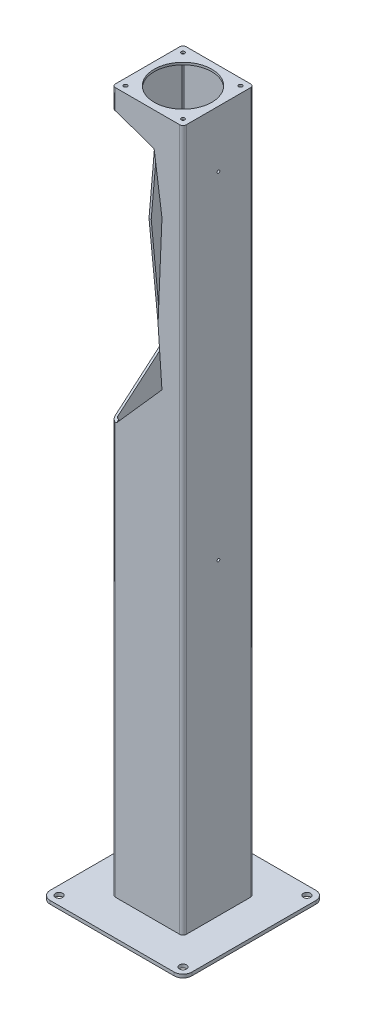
ISO-10303-21;
HEADER;
FILE_DESCRIPTION(('STEP AP214'),'2;1');
FILE_NAME('part.step','',(''),(''),'','','');
FILE_SCHEMA(('AUTOMOTIVE_DESIGN { 1 0 10303 214 1 1 1 1 }'));
ENDSEC;
DATA;
#1=APPLICATION_CONTEXT('core data for automotive mechanical design processes');
#2=APPLICATION_PROTOCOL_DEFINITION('international standard','automotive_design',2000,#1);
#3=PRODUCT_CONTEXT('',#1,'mechanical');
#4=PRODUCT('Part','Part','',(#3));
#5=PRODUCT_RELATED_PRODUCT_CATEGORY('part','',(#4));
#6=PRODUCT_DEFINITION_FORMATION('','',#4);
#7=PRODUCT_DEFINITION_CONTEXT('part definition',#1,'design');
#8=PRODUCT_DEFINITION('design','',#6,#7);
#9=PRODUCT_DEFINITION_SHAPE('','',#8);
#10=(LENGTH_UNIT() NAMED_UNIT(*) SI_UNIT(.MILLI.,.METRE.));
#11=(NAMED_UNIT(*) PLANE_ANGLE_UNIT() SI_UNIT($,.RADIAN.));
#12=(NAMED_UNIT(*) SI_UNIT($,.STERADIAN.) SOLID_ANGLE_UNIT());
#13=UNCERTAINTY_MEASURE_WITH_UNIT(LENGTH_MEASURE(1.E-05),#10,'distance_accuracy_value','');
#14=(GEOMETRIC_REPRESENTATION_CONTEXT(3) GLOBAL_UNCERTAINTY_ASSIGNED_CONTEXT((#13)) GLOBAL_UNIT_ASSIGNED_CONTEXT((#10,
#11,#12)) REPRESENTATION_CONTEXT('',''));
#15=CARTESIAN_POINT('',(0.,0.,0.));
#16=DIRECTION('',(0.,0.,1.));
#17=DIRECTION('',(1.,0.,0.));
#18=AXIS2_PLACEMENT_3D('',#15,#16,#17);
#19=CARTESIAN_POINT('',(-44.45,981.734205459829,50.8));
#20=DIRECTION('',(0.,0.956563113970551,-0.291525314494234));
#21=DIRECTION('',(0.,0.291525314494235,0.956563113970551));
#22=AXIS2_PLACEMENT_3D('',#19,#20,#21);
#23=PLANE('',#22);
#24=DIRECTION('',(1.,0.,0.));
#25=VECTOR('',#24,1.);
#26=CARTESIAN_POINT('',(-45.974,980.766582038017,47.625));
#27=LINE('',#26,#25);
#28=CARTESIAN_POINT('',(-45.974,980.766582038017,47.625));
#29=VERTEX_POINT('',#28);
#30=CARTESIAN_POINT('',(-45.2100930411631,980.766582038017,47.625));
#31=VERTEX_POINT('',#30);
#32=EDGE_CURVE('E734',#29,#31,#27,.T.);
#33=ORIENTED_EDGE('',*,*,#32,.T.);
#34=DIRECTION('',(-0.000574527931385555,0.291525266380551,0.956562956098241));
#35=VECTOR('',#34,1.);
#36=CARTESIAN_POINT('',(-45.2119997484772,981.7340778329,50.7995812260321));
#37=LINE('',#36,#35);
#38=CARTESIAN_POINT('',(-45.212,981.734205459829,50.8));
#39=VERTEX_POINT('',#38);
#40=EDGE_CURVE('E783',#31,#39,#37,.T.);
#41=ORIENTED_EDGE('',*,*,#40,.T.);
#42=DIRECTION('',(-1.,0.,0.));
#43=VECTOR('',#42,1.);
#44=CARTESIAN_POINT('',(-44.45,981.734205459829,50.8));
#45=LINE('',#44,#43);
#46=CARTESIAN_POINT('',(-45.974,981.734205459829,50.8));
#47=VERTEX_POINT('',#46);
#48=EDGE_CURVE('E393',#39,#47,#45,.T.);
#49=ORIENTED_EDGE('',*,*,#48,.T.);
#50=CARTESIAN_POINT('',(-45.974,980.263417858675,45.974));
#51=DIRECTION('',(0.,0.956563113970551,-0.291525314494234));
#52=DIRECTION('',(0.,-0.291525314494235,-0.956563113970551));
#53=AXIS2_PLACEMENT_3D('',#50,#51,#52);
#54=ELLIPSE('',#53,5.04514540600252,4.82599999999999);
#55=CARTESIAN_POINT('',(-50.8,980.263417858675,45.974));
#56=VERTEX_POINT('',#55);
#57=EDGE_CURVE('E396',#56,#47,#54,.T.);
#58=ORIENTED_EDGE('',*,*,#57,.F.);
#59=DIRECTION('',(0.,-0.291525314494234,-0.956563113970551));
#60=VECTOR('',#59,1.);
#61=CARTESIAN_POINT('',(-50.8,981.734205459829,50.8));
#62=LINE('',#61,#60);
#63=CARTESIAN_POINT('',(-50.8,968.333663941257,6.82967191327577));
#64=VERTEX_POINT('',#63);
#65=EDGE_CURVE('E792',#56,#64,#62,.T.);
#66=ORIENTED_EDGE('',*,*,#65,.T.);
#67=DIRECTION('',(-1.,0.,0.));
#68=VECTOR('',#67,1.);
#69=CARTESIAN_POINT('',(-44.45,968.333663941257,6.82967191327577));
#70=LINE('',#69,#68);
#71=CARTESIAN_POINT('',(-47.625,968.333663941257,6.82967191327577));
#72=VERTEX_POINT('',#71);
#73=EDGE_CURVE('E389',#72,#64,#70,.T.);
#74=ORIENTED_EDGE('',*,*,#73,.F.);
#75=DIRECTION('',(0.,0.291525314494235,0.956563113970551));
#76=VECTOR('',#75,1.);
#77=CARTESIAN_POINT('',(-47.625,957.202088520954,-29.6956448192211));
#78=LINE('',#77,#76);
#79=CARTESIAN_POINT('',(-47.625,980.263417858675,45.974));
#80=VERTEX_POINT('',#79);
#81=EDGE_CURVE('E378',#72,#80,#78,.T.);
#82=ORIENTED_EDGE('',*,*,#81,.T.);
#83=CARTESIAN_POINT('',(-45.974,980.263417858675,45.974));
#84=DIRECTION('',(0.,0.956563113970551,-0.291525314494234));
#85=DIRECTION('',(0.,-0.291525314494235,-0.956563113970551));
#86=AXIS2_PLACEMENT_3D('',#83,#84,#85);
#87=ELLIPSE('',#86,1.72597079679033,1.65099999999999);
#88=EDGE_CURVE('E375',#80,#29,#87,.T.);
#89=ORIENTED_EDGE('',*,*,#88,.T.);
#90=EDGE_LOOP('',(#33,#41,#49,#58,#66,#74,#82,#89));
#91=FACE_BOUND('',#90,.T.);
#92=ADVANCED_FACE('F32',(#91),#23,.F.);
#93=CARTESIAN_POINT('',(-45.974,1010.6152,45.974));
#94=DIRECTION('',(0.,-1.,0.));
#95=DIRECTION('',(0.,0.,-1.));
#96=AXIS2_PLACEMENT_3D('',#93,#94,#95);
#97=CYLINDRICAL_SURFACE('',#96,4.82599999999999);
#98=DIRECTION('',(0.,-1.,0.));
#99=VECTOR('',#98,1.);
#100=CARTESIAN_POINT('',(-45.974,1010.6152,50.8));
#101=LINE('',#100,#99);
#102=CARTESIAN_POINT('',(-45.974,595.082415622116,50.8));
#103=VERTEX_POINT('',#102);
#104=CARTESIAN_POINT('',(-45.974,4.7752,50.8));
#105=VERTEX_POINT('',#104);
#106=EDGE_CURVE('E629',#103,#105,#101,.T.);
#107=ORIENTED_EDGE('',*,*,#106,.F.);
#108=CARTESIAN_POINT('',(-45.974,599.201125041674,45.974));
#109=DIRECTION('',(0.,-0.760645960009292,-0.649166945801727));
#110=DIRECTION('',(0.,-0.649166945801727,0.760645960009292));
#111=AXIS2_PLACEMENT_3D('',#108,#109,#110);
#112=ELLIPSE('',#111,6.34460741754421,4.82599999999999);
#113=CARTESIAN_POINT('',(-50.8,599.201125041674,45.974));
#114=VERTEX_POINT('',#113);
#115=EDGE_CURVE('E374',#103,#114,#112,.T.);
#116=ORIENTED_EDGE('',*,*,#115,.T.);
#117=DIRECTION('',(0.,-1.,0.));
#118=VECTOR('',#117,1.);
#119=CARTESIAN_POINT('',(-50.8,1010.6152,45.974));
#120=LINE('',#119,#118);
#121=CARTESIAN_POINT('',(-50.8,4.7752,45.974));
#122=VERTEX_POINT('',#121);
#123=EDGE_CURVE('E633',#114,#122,#120,.T.);
#124=ORIENTED_EDGE('',*,*,#123,.T.);
#125=CARTESIAN_POINT('',(-45.974,4.7752,45.974));
#126=DIRECTION('',(0.,1.,0.));
#127=DIRECTION('',(0.,0.,1.));
#128=AXIS2_PLACEMENT_3D('',#125,#126,#127);
#129=CIRCLE('',#128,4.82599999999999);
#130=EDGE_CURVE('E622',#122,#105,#129,.T.);
#131=ORIENTED_EDGE('',*,*,#130,.T.);
#132=EDGE_LOOP('',(#107,#116,#124,#131));
#133=FACE_BOUND('',#132,.T.);
#134=ADVANCED_FACE('F809',(#133),#97,.T.);
#135=CARTESIAN_POINT('',(-45.974,1010.6152,45.974));
#136=DIRECTION('',(0.,-1.,0.));
#137=DIRECTION('',(0.,0.,-1.));
#138=AXIS2_PLACEMENT_3D('',#135,#136,#137);
#139=CYLINDRICAL_SURFACE('',#138,1.65099999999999);
#140=CARTESIAN_POINT('',(-45.974,599.201125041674,45.974));
#141=DIRECTION('',(0.,-0.760645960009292,-0.649166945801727));
#142=DIRECTION('',(0.,-0.649166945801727,0.760645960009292));
#143=AXIS2_PLACEMENT_3D('',#140,#141,#142);
#144=ELLIPSE('',#143,2.17052359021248,1.65099999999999);
#145=CARTESIAN_POINT('',(-45.974,597.792092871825,47.625));
#146=VERTEX_POINT('',#145);
#147=CARTESIAN_POINT('',(-47.625,599.201125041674,45.974));
#148=VERTEX_POINT('',#147);
#149=EDGE_CURVE('E399',#146,#148,#144,.T.);
#150=ORIENTED_EDGE('',*,*,#149,.F.);
#151=DIRECTION('',(0.,1.,0.));
#152=VECTOR('',#151,1.);
#153=CARTESIAN_POINT('',(-45.974,1010.6152,47.625));
#154=LINE('',#153,#152);
#155=CARTESIAN_POINT('',(-45.974,1.60019999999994,47.625));
#156=VERTEX_POINT('',#155);
#157=EDGE_CURVE('E526',#146,#156,#154,.F.);
#158=ORIENTED_EDGE('',*,*,#157,.T.);
#159=CARTESIAN_POINT('',(-45.974,1.60019999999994,45.974));
#160=DIRECTION('',(0.,1.,0.));
#161=DIRECTION('',(0.,0.,1.));
#162=AXIS2_PLACEMENT_3D('',#159,#160,#161);
#163=CIRCLE('',#162,1.65099999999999);
#164=CARTESIAN_POINT('',(-47.625,1.60019999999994,45.974));
#165=VERTEX_POINT('',#164);
#166=EDGE_CURVE('E446',#165,#156,#163,.T.);
#167=ORIENTED_EDGE('',*,*,#166,.F.);
#168=DIRECTION('',(0.,-1.,0.));
#169=VECTOR('',#168,1.);
#170=CARTESIAN_POINT('',(-47.625,1010.6152,45.974));
#171=LINE('',#170,#169);
#172=EDGE_CURVE('E550',#148,#165,#171,.T.);
#173=ORIENTED_EDGE('',*,*,#172,.F.);
#174=EDGE_LOOP('',(#150,#158,#167,#173));
#175=FACE_BOUND('',#174,.T.);
#176=ADVANCED_FACE('F887',(#175),#139,.F.);
#177=CARTESIAN_POINT('',(-88.9,0.,88.9));
#178=DIRECTION('',(0.,1.,0.));
#179=DIRECTION('',(0.,0.,1.));
#180=AXIS2_PLACEMENT_3D('',#177,#178,#179);
#181=PLANE('',#180);
#182=CARTESIAN_POINT('',(-88.9,0.,-88.9));
#183=DIRECTION('',(0.,1.,0.));
#184=DIRECTION('',(0.,0.,1.));
#185=AXIS2_PLACEMENT_3D('',#182,#183,#184);
#186=CIRCLE('',#185,5.20700000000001);
#187=CARTESIAN_POINT('',(-88.9,0.,-83.693));
#188=VERTEX_POINT('',#187);
#189=EDGE_CURVE('E668',#188,#188,#186,.T.);
#190=ORIENTED_EDGE('',*,*,#189,.T.);
#191=EDGE_LOOP('',(#190));
#192=FACE_BOUND('',#191,.T.);
#193=CARTESIAN_POINT('',(-88.9,0.,-88.9));
#194=DIRECTION('',(0.,1.,0.));
#195=DIRECTION('',(0.,0.,1.));
#196=AXIS2_PLACEMENT_3D('',#193,#194,#195);
#197=CIRCLE('',#196,8.38200000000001);
#198=CARTESIAN_POINT('',(-88.9,0.,-80.518));
#199=VERTEX_POINT('',#198);
#200=EDGE_CURVE('E472',#199,#199,#197,.T.);
#201=ORIENTED_EDGE('',*,*,#200,.F.);
#202=EDGE_LOOP('',(#201));
#203=FACE_BOUND('',#202,.T.);
#204=ADVANCED_FACE('F1044',(#192,#203),#181,.F.);
#205=CARTESIAN_POINT('',(88.9,0.,-88.9));
#206=DIRECTION('',(0.,1.,0.));
#207=DIRECTION('',(0.,0.,1.));
#208=AXIS2_PLACEMENT_3D('',#205,#206,#207);
#209=CIRCLE('',#208,5.20699999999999);
#210=CARTESIAN_POINT('',(88.9,0.,-83.693));
#211=VERTEX_POINT('',#210);
#212=EDGE_CURVE('E662',#211,#211,#209,.T.);
#213=ORIENTED_EDGE('',*,*,#212,.T.);
#214=EDGE_LOOP('',(#213));
#215=FACE_BOUND('',#214,.T.);
#216=CARTESIAN_POINT('',(88.9,0.,-88.9));
#217=DIRECTION('',(0.,1.,0.));
#218=DIRECTION('',(0.,0.,1.));
#219=AXIS2_PLACEMENT_3D('',#216,#217,#218);
#220=CIRCLE('',#219,8.38199999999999);
#221=CARTESIAN_POINT('',(88.9,0.,-80.518));
#222=VERTEX_POINT('',#221);
#223=EDGE_CURVE('E466',#222,#222,#220,.T.);
#224=ORIENTED_EDGE('',*,*,#223,.F.);
#225=EDGE_LOOP('',(#224));
#226=FACE_BOUND('',#225,.T.);
#227=ADVANCED_FACE('F1300',(#215,#226),#181,.F.);
#228=CARTESIAN_POINT('',(88.9,0.,88.9));
#229=DIRECTION('',(0.,1.,0.));
#230=DIRECTION('',(0.,0.,1.));
#231=AXIS2_PLACEMENT_3D('',#228,#229,#230);
#232=CIRCLE('',#231,5.20700000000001);
#233=CARTESIAN_POINT('',(88.9,0.,94.107));
#234=VERTEX_POINT('',#233);
#235=EDGE_CURVE('E656',#234,#234,#232,.T.);
#236=ORIENTED_EDGE('',*,*,#235,.T.);
#237=EDGE_LOOP('',(#236));
#238=FACE_BOUND('',#237,.T.);
#239=CARTESIAN_POINT('',(88.9,0.,88.9));
#240=DIRECTION('',(0.,1.,0.));
#241=DIRECTION('',(0.,0.,1.));
#242=AXIS2_PLACEMENT_3D('',#239,#240,#241);
#243=CIRCLE('',#242,8.38200000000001);
#244=CARTESIAN_POINT('',(88.9,0.,97.282));
#245=VERTEX_POINT('',#244);
#246=EDGE_CURVE('E467',#245,#245,#243,.T.);
#247=ORIENTED_EDGE('',*,*,#246,.F.);
#248=EDGE_LOOP('',(#247));
#249=FACE_BOUND('',#248,.T.);
#250=ADVANCED_FACE('F1311',(#238,#249),#181,.F.);
#251=CARTESIAN_POINT('',(-88.9,0.,88.9));
#252=DIRECTION('',(0.,1.,0.));
#253=DIRECTION('',(0.,0.,1.));
#254=AXIS2_PLACEMENT_3D('',#251,#252,#253);
#255=CIRCLE('',#254,5.20700000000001);
#256=CARTESIAN_POINT('',(-88.9,0.,94.107));
#257=VERTEX_POINT('',#256);
#258=EDGE_CURVE('E652',#257,#257,#255,.T.);
#259=ORIENTED_EDGE('',*,*,#258,.T.);
#260=EDGE_LOOP('',(#259));
#261=FACE_BOUND('',#260,.T.);
#262=CARTESIAN_POINT('',(-88.9,0.,88.9));
#263=DIRECTION('',(0.,1.,0.));
#264=DIRECTION('',(0.,0.,1.));
#265=AXIS2_PLACEMENT_3D('',#262,#263,#264);
#266=CIRCLE('',#265,8.38200000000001);
#267=CARTESIAN_POINT('',(-88.9,0.,97.282));
#268=VERTEX_POINT('',#267);
#269=EDGE_CURVE('E498',#268,#268,#266,.T.);
#270=ORIENTED_EDGE('',*,*,#269,.F.);
#271=EDGE_LOOP('',(#270));
#272=FACE_BOUND('',#271,.T.);
#273=ADVANCED_FACE('F1319',(#261,#272),#181,.F.);
#274=CARTESIAN_POINT('',(-88.9,4.7752,88.9));
#275=DIRECTION('',(0.,1.,0.));
#276=DIRECTION('',(0.,0.,1.));
#277=AXIS2_PLACEMENT_3D('',#274,#275,#276);
#278=PLANE('',#277);
#279=CARTESIAN_POINT('',(45.974,4.7752,45.974));
#280=DIRECTION('',(0.,1.,0.));
#281=DIRECTION('',(0.,0.,1.));
#282=AXIS2_PLACEMENT_3D('',#279,#280,#281);
#283=CIRCLE('',#282,4.82599999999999);
#284=CARTESIAN_POINT('',(45.974,4.7752,50.8));
#285=VERTEX_POINT('',#284);
#286=CARTESIAN_POINT('',(50.8,4.7752,45.974));
#287=VERTEX_POINT('',#286);
#288=EDGE_CURVE('E502',#285,#287,#283,.T.);
#289=ORIENTED_EDGE('',*,*,#288,.F.);
#290=DIRECTION('',(1.,0.,0.));
#291=VECTOR('',#290,1.);
#292=CARTESIAN_POINT('',(-45.974,4.7752,50.8));
#293=LINE('',#292,#291);
#294=EDGE_CURVE('E590',#105,#285,#293,.T.);
#295=ORIENTED_EDGE('',*,*,#294,.F.);
#296=ORIENTED_EDGE('',*,*,#130,.F.);
#297=DIRECTION('',(0.,0.,1.));
#298=VECTOR('',#297,1.);
#299=CARTESIAN_POINT('',(-50.8,4.7752,-45.974));
#300=LINE('',#299,#298);
#301=CARTESIAN_POINT('',(-50.8,4.7752,-45.974));
#302=VERTEX_POINT('',#301);
#303=EDGE_CURVE('E619',#302,#122,#300,.T.);
#304=ORIENTED_EDGE('',*,*,#303,.F.);
#305=CARTESIAN_POINT('',(-45.974,4.7752,-45.974));
#306=DIRECTION('',(0.,1.,0.));
#307=DIRECTION('',(0.,0.,1.));
#308=AXIS2_PLACEMENT_3D('',#305,#306,#307);
#309=CIRCLE('',#308,4.82599999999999);
#310=CARTESIAN_POINT('',(-45.974,4.7752,-50.8));
#311=VERTEX_POINT('',#310);
#312=EDGE_CURVE('E616',#311,#302,#309,.T.);
#313=ORIENTED_EDGE('',*,*,#312,.F.);
#314=DIRECTION('',(-1.,0.,0.));
#315=VECTOR('',#314,1.);
#316=CARTESIAN_POINT('',(-45.974,4.7752,-50.8));
#317=LINE('',#316,#315);
#318=CARTESIAN_POINT('',(45.974,4.7752,-50.8));
#319=VERTEX_POINT('',#318);
#320=EDGE_CURVE('E613',#319,#311,#317,.T.);
#321=ORIENTED_EDGE('',*,*,#320,.F.);
#322=CARTESIAN_POINT('',(45.974,4.7752,-45.974));
#323=DIRECTION('',(0.,1.,0.));
#324=DIRECTION('',(0.,0.,-1.));
#325=AXIS2_PLACEMENT_3D('',#322,#323,#324);
#326=CIRCLE('',#325,4.82599999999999);
#327=CARTESIAN_POINT('',(50.8,4.7752,-45.974));
#328=VERTEX_POINT('',#327);
#329=EDGE_CURVE('E610',#328,#319,#326,.T.);
#330=ORIENTED_EDGE('',*,*,#329,.F.);
#331=DIRECTION('',(0.,0.,-1.));
#332=VECTOR('',#331,1.);
#333=CARTESIAN_POINT('',(50.8,4.7752,-45.974));
#334=LINE('',#333,#332);
#335=EDGE_CURVE('E607',#287,#328,#334,.T.);
#336=ORIENTED_EDGE('',*,*,#335,.F.);
#337=EDGE_LOOP('',(#289,#295,#296,#304,#313,#321,#330,#336));
#338=FACE_BOUND('',#337,.T.);
#339=CARTESIAN_POINT('',(88.9,4.7752,88.9));
#340=DIRECTION('',(0.,1.,0.));
#341=DIRECTION('',(0.,0.,1.));
#342=AXIS2_PLACEMENT_3D('',#339,#340,#341);
#343=CIRCLE('',#342,5.20700000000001);
#344=CARTESIAN_POINT('',(88.9,4.7752,94.107));
#345=VERTEX_POINT('',#344);
#346=EDGE_CURVE('E659',#345,#345,#343,.T.);
#347=ORIENTED_EDGE('',*,*,#346,.F.);
#348=EDGE_LOOP('',(#347));
#349=FACE_BOUND('',#348,.T.);
#350=CARTESIAN_POINT('',(-88.9,4.7752,-88.9));
#351=DIRECTION('',(0.,1.,0.));
#352=DIRECTION('',(0.,0.,1.));
#353=AXIS2_PLACEMENT_3D('',#350,#351,#352);
#354=CIRCLE('',#353,5.20700000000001);
#355=CARTESIAN_POINT('',(-88.9,4.7752,-83.693));
#356=VERTEX_POINT('',#355);
#357=EDGE_CURVE('E671',#356,#356,#354,.T.);
#358=ORIENTED_EDGE('',*,*,#357,.F.);
#359=EDGE_LOOP('',(#358));
#360=FACE_BOUND('',#359,.T.);
#361=CARTESIAN_POINT('',(-88.9,4.7752,88.9));
#362=DIRECTION('',(0.,1.,0.));
#363=DIRECTION('',(0.,0.,1.));
#364=AXIS2_PLACEMENT_3D('',#361,#362,#363);
#365=CIRCLE('',#364,12.7);
#366=CARTESIAN_POINT('',(-101.6,4.7752,88.9));
#367=VERTEX_POINT('',#366);
#368=CARTESIAN_POINT('',(-88.9,4.7752,101.6));
#369=VERTEX_POINT('',#368);
#370=EDGE_CURVE('E677',#367,#369,#365,.T.);
#371=ORIENTED_EDGE('',*,*,#370,.T.);
#372=DIRECTION('',(1.,0.,0.));
#373=VECTOR('',#372,1.);
#374=CARTESIAN_POINT('',(-88.9,4.7752,101.6));
#375=LINE('',#374,#373);
#376=CARTESIAN_POINT('',(88.9,4.7752,101.6));
#377=VERTEX_POINT('',#376);
#378=EDGE_CURVE('E680',#369,#377,#375,.T.);
#379=ORIENTED_EDGE('',*,*,#378,.T.);
#380=CARTESIAN_POINT('',(88.9,4.7752,88.9));
#381=DIRECTION('',(0.,1.,0.));
#382=DIRECTION('',(0.,0.,1.));
#383=AXIS2_PLACEMENT_3D('',#380,#381,#382);
#384=CIRCLE('',#383,12.7);
#385=CARTESIAN_POINT('',(101.6,4.7752,88.9));
#386=VERTEX_POINT('',#385);
#387=EDGE_CURVE('E683',#377,#386,#384,.T.);
#388=ORIENTED_EDGE('',*,*,#387,.T.);
#389=DIRECTION('',(0.,0.,-1.));
#390=VECTOR('',#389,1.);
#391=CARTESIAN_POINT('',(101.6,4.7752,-88.9));
#392=LINE('',#391,#390);
#393=CARTESIAN_POINT('',(101.6,4.7752,-88.9));
#394=VERTEX_POINT('',#393);
#395=EDGE_CURVE('E685',#386,#394,#392,.T.);
#396=ORIENTED_EDGE('',*,*,#395,.T.);
#397=CARTESIAN_POINT('',(88.9,4.7752,-88.9));
#398=DIRECTION('',(0.,1.,0.));
#399=DIRECTION('',(0.,0.,-1.));
#400=AXIS2_PLACEMENT_3D('',#397,#398,#399);
#401=CIRCLE('',#400,12.7);
#402=CARTESIAN_POINT('',(88.9,4.7752,-101.6));
#403=VERTEX_POINT('',#402);
#404=EDGE_CURVE('E687',#394,#403,#401,.T.);
#405=ORIENTED_EDGE('',*,*,#404,.T.);
#406=DIRECTION('',(-1.,0.,0.));
#407=VECTOR('',#406,1.);
#408=CARTESIAN_POINT('',(-88.9,4.7752,-101.6));
#409=LINE('',#408,#407);
#410=CARTESIAN_POINT('',(-88.9,4.7752,-101.6));
#411=VERTEX_POINT('',#410);
#412=EDGE_CURVE('E689',#403,#411,#409,.T.);
#413=ORIENTED_EDGE('',*,*,#412,.T.);
#414=CARTESIAN_POINT('',(-88.9,4.7752,-88.9));
#415=DIRECTION('',(0.,1.,0.));
#416=DIRECTION('',(0.,0.,1.));
#417=AXIS2_PLACEMENT_3D('',#414,#415,#416);
#418=CIRCLE('',#417,12.7);
#419=CARTESIAN_POINT('',(-101.6,4.7752,-88.9));
#420=VERTEX_POINT('',#419);
#421=EDGE_CURVE('E691',#411,#420,#418,.T.);
#422=ORIENTED_EDGE('',*,*,#421,.T.);
#423=DIRECTION('',(0.,0.,1.));
#424=VECTOR('',#423,1.);
#425=CARTESIAN_POINT('',(-101.6,4.7752,-88.9));
#426=LINE('',#425,#424);
#427=EDGE_CURVE('E693',#420,#367,#426,.T.);
#428=ORIENTED_EDGE('',*,*,#427,.T.);
#429=EDGE_LOOP('',(#371,#379,#388,#396,#405,#413,#422,#428));
#430=FACE_BOUND('',#429,.T.);
#431=CARTESIAN_POINT('',(88.9,4.7752,-88.9));
#432=DIRECTION('',(0.,1.,0.));
#433=DIRECTION('',(0.,0.,1.));
#434=AXIS2_PLACEMENT_3D('',#431,#432,#433);
#435=CIRCLE('',#434,5.20699999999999);
#436=CARTESIAN_POINT('',(88.9,4.7752,-83.693));
#437=VERTEX_POINT('',#436);
#438=EDGE_CURVE('E665',#437,#437,#435,.T.);
#439=ORIENTED_EDGE('',*,*,#438,.F.);
#440=EDGE_LOOP('',(#439));
#441=FACE_BOUND('',#440,.T.);
#442=CARTESIAN_POINT('',(-88.9,4.7752,88.9));
#443=DIRECTION('',(0.,1.,0.));
#444=DIRECTION('',(0.,0.,1.));
#445=AXIS2_PLACEMENT_3D('',#442,#443,#444);
#446=CIRCLE('',#445,5.20700000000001);
#447=CARTESIAN_POINT('',(-88.9,4.7752,94.107));
#448=VERTEX_POINT('',#447);
#449=EDGE_CURVE('E653',#448,#448,#446,.T.);
#450=ORIENTED_EDGE('',*,*,#449,.F.);
#451=EDGE_LOOP('',(#450));
#452=FACE_BOUND('',#451,.T.);
#453=ADVANCED_FACE('F815',(#338,#349,#360,#430,#441,#452),#278,.T.);
#454=DIRECTION('',(0.,0.,1.));
#455=VECTOR('',#454,1.);
#456=CARTESIAN_POINT('',(-98.425,0.,-88.9));
#457=LINE('',#456,#455);
#458=CARTESIAN_POINT('',(-98.425,0.,-88.9));
#459=VERTEX_POINT('',#458);
#460=CARTESIAN_POINT('',(-98.425,0.,88.9));
#461=VERTEX_POINT('',#460);
#462=EDGE_CURVE('E477',#459,#461,#457,.T.);
#463=ORIENTED_EDGE('',*,*,#462,.T.);
#464=CARTESIAN_POINT('',(-88.9,0.,88.9));
#465=DIRECTION('',(0.,1.,0.));
#466=DIRECTION('',(0.,0.,1.));
#467=AXIS2_PLACEMENT_3D('',#464,#465,#466);
#468=CIRCLE('',#467,9.525);
#469=CARTESIAN_POINT('',(-88.9,0.,98.425));
#470=VERTEX_POINT('',#469);
#471=EDGE_CURVE('E471',#461,#470,#468,.T.);
#472=ORIENTED_EDGE('',*,*,#471,.T.);
#473=DIRECTION('',(1.,0.,0.));
#474=VECTOR('',#473,1.);
#475=CARTESIAN_POINT('',(-88.9,0.,98.425));
#476=LINE('',#475,#474);
#477=CARTESIAN_POINT('',(88.9,0.,98.425));
#478=VERTEX_POINT('',#477);
#479=EDGE_CURVE('E560',#470,#478,#476,.T.);
#480=ORIENTED_EDGE('',*,*,#479,.T.);
#481=CARTESIAN_POINT('',(88.9,0.,88.9));
#482=DIRECTION('',(0.,1.,0.));
#483=DIRECTION('',(0.,0.,1.));
#484=AXIS2_PLACEMENT_3D('',#481,#482,#483);
#485=CIRCLE('',#484,9.52500000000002);
#486=CARTESIAN_POINT('',(98.425,0.,88.9));
#487=VERTEX_POINT('',#486);
#488=EDGE_CURVE('E55',#478,#487,#485,.T.);
#489=ORIENTED_EDGE('',*,*,#488,.T.);
#490=DIRECTION('',(0.,0.,-1.));
#491=VECTOR('',#490,1.);
#492=CARTESIAN_POINT('',(98.425,0.,-88.9));
#493=LINE('',#492,#491);
#494=CARTESIAN_POINT('',(98.425,0.,-88.9));
#495=VERTEX_POINT('',#494);
#496=EDGE_CURVE('E572',#487,#495,#493,.T.);
#497=ORIENTED_EDGE('',*,*,#496,.T.);
#498=CARTESIAN_POINT('',(88.9,0.,-88.9));
#499=DIRECTION('',(0.,1.,0.));
#500=DIRECTION('',(0.,0.,1.));
#501=AXIS2_PLACEMENT_3D('',#498,#499,#500);
#502=CIRCLE('',#501,9.52500000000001);
#503=CARTESIAN_POINT('',(88.9,0.,-98.425));
#504=VERTEX_POINT('',#503);
#505=EDGE_CURVE('E569',#495,#504,#502,.T.);
#506=ORIENTED_EDGE('',*,*,#505,.T.);
#507=DIRECTION('',(-1.,0.,0.));
#508=VECTOR('',#507,1.);
#509=CARTESIAN_POINT('',(-88.9,0.,-98.425));
#510=LINE('',#509,#508);
#511=CARTESIAN_POINT('',(-88.9,0.,-98.425));
#512=VERTEX_POINT('',#511);
#513=EDGE_CURVE('E566',#504,#512,#510,.T.);
#514=ORIENTED_EDGE('',*,*,#513,.T.);
#515=CARTESIAN_POINT('',(-88.9,0.,-88.9));
#516=DIRECTION('',(0.,1.,0.));
#517=DIRECTION('',(0.,0.,1.));
#518=AXIS2_PLACEMENT_3D('',#515,#516,#517);
#519=CIRCLE('',#518,9.525);
#520=EDGE_CURVE('E563',#512,#459,#519,.T.);
#521=ORIENTED_EDGE('',*,*,#520,.T.);
#522=EDGE_LOOP('',(#463,#472,#480,#489,#497,#506,#514,#521));
#523=FACE_BOUND('',#522,.T.);
#524=CARTESIAN_POINT('',(-88.9,0.,88.9));
#525=DIRECTION('',(0.,1.,0.));
#526=DIRECTION('',(0.,0.,1.));
#527=AXIS2_PLACEMENT_3D('',#524,#525,#526);
#528=CIRCLE('',#527,12.7);
#529=CARTESIAN_POINT('',(-101.6,0.,88.9));
#530=VERTEX_POINT('',#529);
#531=CARTESIAN_POINT('',(-88.9,0.,101.6));
#532=VERTEX_POINT('',#531);
#533=EDGE_CURVE('E674',#530,#532,#528,.T.);
#534=ORIENTED_EDGE('',*,*,#533,.F.);
#535=DIRECTION('',(0.,0.,1.));
#536=VECTOR('',#535,1.);
#537=CARTESIAN_POINT('',(-101.6,0.,-88.9));
#538=LINE('',#537,#536);
#539=CARTESIAN_POINT('',(-101.6,0.,-88.9));
#540=VERTEX_POINT('',#539);
#541=EDGE_CURVE('E681',#540,#530,#538,.T.);
#542=ORIENTED_EDGE('',*,*,#541,.F.);
#543=CARTESIAN_POINT('',(-88.9,0.,-88.9));
#544=DIRECTION('',(0.,1.,0.));
#545=DIRECTION('',(0.,0.,1.));
#546=AXIS2_PLACEMENT_3D('',#543,#544,#545);
#547=CIRCLE('',#546,12.7);
#548=CARTESIAN_POINT('',(-88.9,0.,-101.6));
#549=VERTEX_POINT('',#548);
#550=EDGE_CURVE('E708',#549,#540,#547,.T.);
#551=ORIENTED_EDGE('',*,*,#550,.F.);
#552=DIRECTION('',(-1.,0.,0.));
#553=VECTOR('',#552,1.);
#554=CARTESIAN_POINT('',(-88.9,0.,-101.6));
#555=LINE('',#554,#553);
#556=CARTESIAN_POINT('',(88.9,0.,-101.6));
#557=VERTEX_POINT('',#556);
#558=EDGE_CURVE('E706',#557,#549,#555,.T.);
#559=ORIENTED_EDGE('',*,*,#558,.F.);
#560=CARTESIAN_POINT('',(88.9,0.,-88.9));
#561=DIRECTION('',(0.,1.,0.));
#562=DIRECTION('',(0.,0.,-1.));
#563=AXIS2_PLACEMENT_3D('',#560,#561,#562);
#564=CIRCLE('',#563,12.7);
#565=CARTESIAN_POINT('',(101.6,0.,-88.9));
#566=VERTEX_POINT('',#565);
#567=EDGE_CURVE('E704',#566,#557,#564,.T.);
#568=ORIENTED_EDGE('',*,*,#567,.F.);
#569=DIRECTION('',(0.,0.,-1.));
#570=VECTOR('',#569,1.);
#571=CARTESIAN_POINT('',(101.6,0.,-88.9));
#572=LINE('',#571,#570);
#573=CARTESIAN_POINT('',(101.6,0.,88.9));
#574=VERTEX_POINT('',#573);
#575=EDGE_CURVE('E702',#574,#566,#572,.T.);
#576=ORIENTED_EDGE('',*,*,#575,.F.);
#577=CARTESIAN_POINT('',(88.9,0.,88.9));
#578=DIRECTION('',(0.,1.,0.));
#579=DIRECTION('',(0.,0.,1.));
#580=AXIS2_PLACEMENT_3D('',#577,#578,#579);
#581=CIRCLE('',#580,12.7);
#582=CARTESIAN_POINT('',(88.9,0.,101.6));
#583=VERTEX_POINT('',#582);
#584=EDGE_CURVE('E700',#583,#574,#581,.T.);
#585=ORIENTED_EDGE('',*,*,#584,.F.);
#586=DIRECTION('',(1.,0.,0.));
#587=VECTOR('',#586,1.);
#588=CARTESIAN_POINT('',(-88.9,0.,101.6));
#589=LINE('',#588,#587);
#590=EDGE_CURVE('E698',#532,#583,#589,.T.);
#591=ORIENTED_EDGE('',*,*,#590,.F.);
#592=EDGE_LOOP('',(#534,#542,#551,#559,#568,#576,#585,#591));
#593=FACE_BOUND('',#592,.T.);
#594=ADVANCED_FACE('F1303',(#523,#593),#181,.F.);
#595=CARTESIAN_POINT('',(-88.9,4.7752,88.9));
#596=DIRECTION('',(0.,-1.,0.));
#597=DIRECTION('',(0.,0.,-1.));
#598=AXIS2_PLACEMENT_3D('',#595,#596,#597);
#599=CYLINDRICAL_SURFACE('',#598,12.7);
#600=ORIENTED_EDGE('',*,*,#533,.T.);
#601=DIRECTION('',(0.,-1.,0.));
#602=VECTOR('',#601,1.);
#603=CARTESIAN_POINT('',(-88.9,4.7752,101.6));
#604=LINE('',#603,#602);
#605=EDGE_CURVE('E731',#369,#532,#604,.T.);
#606=ORIENTED_EDGE('',*,*,#605,.F.);
#607=ORIENTED_EDGE('',*,*,#370,.F.);
#608=DIRECTION('',(0.,-1.,0.));
#609=VECTOR('',#608,1.);
#610=CARTESIAN_POINT('',(-101.6,4.7752,88.9));
#611=LINE('',#610,#609);
#612=EDGE_CURVE('E695',#367,#530,#611,.T.);
#613=ORIENTED_EDGE('',*,*,#612,.T.);
#614=EDGE_LOOP('',(#600,#606,#607,#613));
#615=FACE_BOUND('',#614,.T.);
#616=ADVANCED_FACE('F34',(#615),#599,.T.);
#617=CARTESIAN_POINT('',(-88.9,4.7752,101.6));
#618=DIRECTION('',(0.,0.,-1.));
#619=DIRECTION('',(-1.,0.,0.));
#620=AXIS2_PLACEMENT_3D('',#617,#618,#619);
#621=PLANE('',#620);
#622=ORIENTED_EDGE('',*,*,#590,.T.);
#623=DIRECTION('',(0.,-1.,0.));
#624=VECTOR('',#623,1.);
#625=CARTESIAN_POINT('',(88.9,4.7752,101.6));
#626=LINE('',#625,#624);
#627=EDGE_CURVE('E728',#377,#583,#626,.T.);
#628=ORIENTED_EDGE('',*,*,#627,.F.);
#629=ORIENTED_EDGE('',*,*,#378,.F.);
#630=ORIENTED_EDGE('',*,*,#605,.T.);
#631=EDGE_LOOP('',(#622,#628,#629,#630));
#632=FACE_BOUND('',#631,.T.);
#633=ADVANCED_FACE('F1475',(#632),#621,.F.);
#634=CARTESIAN_POINT('',(88.9,4.7752,88.9));
#635=DIRECTION('',(0.,-1.,0.));
#636=DIRECTION('',(0.,0.,-1.));
#637=AXIS2_PLACEMENT_3D('',#634,#635,#636);
#638=CYLINDRICAL_SURFACE('',#637,12.7);
#639=ORIENTED_EDGE('',*,*,#584,.T.);
#640=DIRECTION('',(0.,-1.,0.));
#641=VECTOR('',#640,1.);
#642=CARTESIAN_POINT('',(101.6,4.7752,88.9));
#643=LINE('',#642,#641);
#644=EDGE_CURVE('E725',#386,#574,#643,.T.);
#645=ORIENTED_EDGE('',*,*,#644,.F.);
#646=ORIENTED_EDGE('',*,*,#387,.F.);
#647=ORIENTED_EDGE('',*,*,#627,.T.);
#648=EDGE_LOOP('',(#639,#645,#646,#647));
#649=FACE_BOUND('',#648,.T.);
#650=ADVANCED_FACE('F1466',(#649),#638,.T.);
#651=CARTESIAN_POINT('',(101.6,4.7752,-88.9));
#652=DIRECTION('',(-1.,0.,0.));
#653=DIRECTION('',(0.,0.,1.));
#654=AXIS2_PLACEMENT_3D('',#651,#652,#653);
#655=PLANE('',#654);
#656=ORIENTED_EDGE('',*,*,#575,.T.);
#657=DIRECTION('',(0.,-1.,0.));
#658=VECTOR('',#657,1.);
#659=CARTESIAN_POINT('',(101.6,4.7752,-88.9));
#660=LINE('',#659,#658);
#661=EDGE_CURVE('E722',#394,#566,#660,.T.);
#662=ORIENTED_EDGE('',*,*,#661,.F.);
#663=ORIENTED_EDGE('',*,*,#395,.F.);
#664=ORIENTED_EDGE('',*,*,#644,.T.);
#665=EDGE_LOOP('',(#656,#662,#663,#664));
#666=FACE_BOUND('',#665,.T.);
#667=ADVANCED_FACE('F1457',(#666),#655,.F.);
#668=CARTESIAN_POINT('',(88.9,4.7752,-88.9));
#669=DIRECTION('',(0.,-1.,0.));
#670=DIRECTION('',(0.,0.,-1.));
#671=AXIS2_PLACEMENT_3D('',#668,#669,#670);
#672=CYLINDRICAL_SURFACE('',#671,12.7);
#673=ORIENTED_EDGE('',*,*,#567,.T.);
#674=DIRECTION('',(0.,-1.,0.));
#675=VECTOR('',#674,1.);
#676=CARTESIAN_POINT('',(88.9,4.7752,-101.6));
#677=LINE('',#676,#675);
#678=EDGE_CURVE('E719',#403,#557,#677,.T.);
#679=ORIENTED_EDGE('',*,*,#678,.F.);
#680=ORIENTED_EDGE('',*,*,#404,.F.);
#681=ORIENTED_EDGE('',*,*,#661,.T.);
#682=EDGE_LOOP('',(#673,#679,#680,#681));
#683=FACE_BOUND('',#682,.T.);
#684=ADVANCED_FACE('F1448',(#683),#672,.T.);
#685=CARTESIAN_POINT('',(-88.9,4.7752,-101.6));
#686=DIRECTION('',(0.,0.,1.));
#687=DIRECTION('',(1.,0.,0.));
#688=AXIS2_PLACEMENT_3D('',#685,#686,#687);
#689=PLANE('',#688);
#690=ORIENTED_EDGE('',*,*,#558,.T.);
#691=DIRECTION('',(0.,-1.,0.));
#692=VECTOR('',#691,1.);
#693=CARTESIAN_POINT('',(-88.9,4.7752,-101.6));
#694=LINE('',#693,#692);
#695=EDGE_CURVE('E716',#411,#549,#694,.T.);
#696=ORIENTED_EDGE('',*,*,#695,.F.);
#697=ORIENTED_EDGE('',*,*,#412,.F.);
#698=ORIENTED_EDGE('',*,*,#678,.T.);
#699=EDGE_LOOP('',(#690,#696,#697,#698));
#700=FACE_BOUND('',#699,.T.);
#701=ADVANCED_FACE('F1439',(#700),#689,.F.);
#702=CARTESIAN_POINT('',(-88.9,4.7752,-88.9));
#703=DIRECTION('',(0.,-1.,0.));
#704=DIRECTION('',(0.,0.,-1.));
#705=AXIS2_PLACEMENT_3D('',#702,#703,#704);
#706=CYLINDRICAL_SURFACE('',#705,12.7);
#707=ORIENTED_EDGE('',*,*,#550,.T.);
#708=DIRECTION('',(0.,-1.,0.));
#709=VECTOR('',#708,1.);
#710=CARTESIAN_POINT('',(-101.6,4.7752,-88.9));
#711=LINE('',#710,#709);
#712=EDGE_CURVE('E713',#420,#540,#711,.T.);
#713=ORIENTED_EDGE('',*,*,#712,.F.);
#714=ORIENTED_EDGE('',*,*,#421,.F.);
#715=ORIENTED_EDGE('',*,*,#695,.T.);
#716=EDGE_LOOP('',(#707,#713,#714,#715));
#717=FACE_BOUND('',#716,.T.);
#718=ADVANCED_FACE('F1430',(#717),#706,.T.);
#719=CARTESIAN_POINT('',(-101.6,4.7752,-88.9));
#720=DIRECTION('',(1.,0.,0.));
#721=DIRECTION('',(0.,0.,-1.));
#722=AXIS2_PLACEMENT_3D('',#719,#720,#721);
#723=PLANE('',#722);
#724=ORIENTED_EDGE('',*,*,#541,.T.);
#725=ORIENTED_EDGE('',*,*,#612,.F.);
#726=ORIENTED_EDGE('',*,*,#427,.F.);
#727=ORIENTED_EDGE('',*,*,#712,.T.);
#728=EDGE_LOOP('',(#724,#725,#726,#727));
#729=FACE_BOUND('',#728,.T.);
#730=ADVANCED_FACE('F1421',(#729),#723,.F.);
#731=CARTESIAN_POINT('',(-88.9,4.7752,-88.9));
#732=DIRECTION('',(0.,-1.,0.));
#733=DIRECTION('',(0.,0.,-1.));
#734=AXIS2_PLACEMENT_3D('',#731,#732,#733);
#735=CYLINDRICAL_SURFACE('',#734,5.20700000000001);
#736=ORIENTED_EDGE('',*,*,#357,.T.);
#737=EDGE_LOOP('',(#736));
#738=FACE_BOUND('',#737,.T.);
#739=ORIENTED_EDGE('',*,*,#189,.F.);
#740=EDGE_LOOP('',(#739));
#741=FACE_BOUND('',#740,.T.);
#742=ADVANCED_FACE('F1412',(#738,#741),#735,.F.);
#743=CARTESIAN_POINT('',(88.9,4.7752,-88.9));
#744=DIRECTION('',(0.,-1.,0.));
#745=DIRECTION('',(0.,0.,-1.));
#746=AXIS2_PLACEMENT_3D('',#743,#744,#745);
#747=CYLINDRICAL_SURFACE('',#746,5.20699999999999);
#748=ORIENTED_EDGE('',*,*,#438,.T.);
#749=EDGE_LOOP('',(#748));
#750=FACE_BOUND('',#749,.T.);
#751=ORIENTED_EDGE('',*,*,#212,.F.);
#752=EDGE_LOOP('',(#751));
#753=FACE_BOUND('',#752,.T.);
#754=ADVANCED_FACE('F1403',(#750,#753),#747,.F.);
#755=CARTESIAN_POINT('',(88.9,4.7752,88.9));
#756=DIRECTION('',(0.,-1.,0.));
#757=DIRECTION('',(0.,0.,-1.));
#758=AXIS2_PLACEMENT_3D('',#755,#756,#757);
#759=CYLINDRICAL_SURFACE('',#758,5.20700000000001);
#760=ORIENTED_EDGE('',*,*,#346,.T.);
#761=EDGE_LOOP('',(#760));
#762=FACE_BOUND('',#761,.T.);
#763=ORIENTED_EDGE('',*,*,#235,.F.);
#764=EDGE_LOOP('',(#763));
#765=FACE_BOUND('',#764,.T.);
#766=ADVANCED_FACE('F1394',(#762,#765),#759,.F.);
#767=CARTESIAN_POINT('',(-88.9,4.7752,88.9));
#768=DIRECTION('',(0.,-1.,0.));
#769=DIRECTION('',(0.,0.,-1.));
#770=AXIS2_PLACEMENT_3D('',#767,#768,#769);
#771=CYLINDRICAL_SURFACE('',#770,5.20700000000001);
#772=ORIENTED_EDGE('',*,*,#449,.T.);
#773=EDGE_LOOP('',(#772));
#774=FACE_BOUND('',#773,.T.);
#775=ORIENTED_EDGE('',*,*,#258,.F.);
#776=EDGE_LOOP('',(#775));
#777=FACE_BOUND('',#776,.T.);
#778=ADVANCED_FACE('F1385',(#774,#777),#771,.F.);
#779=CARTESIAN_POINT('',(45.974,1010.6152,45.974));
#780=DIRECTION('',(0.,-1.,0.));
#781=DIRECTION('',(0.,0.,-1.));
#782=AXIS2_PLACEMENT_3D('',#779,#780,#781);
#783=CYLINDRICAL_SURFACE('',#782,4.82599999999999);
#784=ORIENTED_EDGE('',*,*,#288,.T.);
#785=DIRECTION('',(0.,-1.,0.));
#786=VECTOR('',#785,1.);
#787=CARTESIAN_POINT('',(50.8,1010.6152,45.974));
#788=LINE('',#787,#786);
#789=CARTESIAN_POINT('',(50.8,1010.6152,45.974));
#790=VERTEX_POINT('',#789);
#791=EDGE_CURVE('E649',#790,#287,#788,.T.);
#792=ORIENTED_EDGE('',*,*,#791,.F.);
#793=CARTESIAN_POINT('',(45.974,1010.6152,45.974));
#794=DIRECTION('',(0.,1.,0.));
#795=DIRECTION('',(0.,0.,1.));
#796=AXIS2_PLACEMENT_3D('',#793,#794,#795);
#797=CIRCLE('',#796,4.82599999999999);
#798=CARTESIAN_POINT('',(45.974,1010.6152,50.8));
#799=VERTEX_POINT('',#798);
#800=EDGE_CURVE('E586',#799,#790,#797,.T.);
#801=ORIENTED_EDGE('',*,*,#800,.F.);
#802=DIRECTION('',(0.,-1.,0.));
#803=VECTOR('',#802,1.);
#804=CARTESIAN_POINT('',(45.974,1010.6152,50.8));
#805=LINE('',#804,#803);
#806=EDGE_CURVE('E604',#799,#285,#805,.T.);
#807=ORIENTED_EDGE('',*,*,#806,.T.);
#808=EDGE_LOOP('',(#784,#792,#801,#807));
#809=FACE_BOUND('',#808,.T.);
#810=ADVANCED_FACE('F837',(#809),#783,.T.);
#811=CARTESIAN_POINT('',(50.8,1010.6152,-45.974));
#812=DIRECTION('',(-1.,0.,0.));
#813=DIRECTION('',(0.,0.,1.));
#814=AXIS2_PLACEMENT_3D('',#811,#812,#813);
#815=PLANE('',#814);
#816=CARTESIAN_POINT('',(50.8,929.3352,0.));
#817=DIRECTION('',(1.,0.,0.));
#818=DIRECTION('',(0.,0.,-1.));
#819=AXIS2_PLACEMENT_3D('',#816,#817,#818);
#820=CIRCLE('',#819,2.01929999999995);
#821=CARTESIAN_POINT('',(50.8,929.3352,-2.01929999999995));
#822=VERTEX_POINT('',#821);
#823=EDGE_CURVE('E404',#822,#822,#820,.T.);
#824=ORIENTED_EDGE('',*,*,#823,.F.);
#825=EDGE_LOOP('',(#824));
#826=FACE_BOUND('',#825,.T.);
#827=CARTESIAN_POINT('',(50.8,446.7352,0.));
#828=DIRECTION('',(1.,0.,0.));
#829=DIRECTION('',(0.,0.,-1.));
#830=AXIS2_PLACEMENT_3D('',#827,#828,#829);
#831=CIRCLE('',#830,2.0193);
#832=CARTESIAN_POINT('',(50.8,446.7352,-2.0193));
#833=VERTEX_POINT('',#832);
#834=EDGE_CURVE('E410',#833,#833,#831,.T.);
#835=ORIENTED_EDGE('',*,*,#834,.F.);
#836=EDGE_LOOP('',(#835));
#837=FACE_BOUND('',#836,.T.);
#838=ORIENTED_EDGE('',*,*,#335,.T.);
#839=DIRECTION('',(0.,-1.,0.));
#840=VECTOR('',#839,1.);
#841=CARTESIAN_POINT('',(50.8,1010.6152,-45.974));
#842=LINE('',#841,#840);
#843=CARTESIAN_POINT('',(50.8,1010.6152,-45.974));
#844=VERTEX_POINT('',#843);
#845=EDGE_CURVE('E646',#844,#328,#842,.T.);
#846=ORIENTED_EDGE('',*,*,#845,.F.);
#847=DIRECTION('',(0.,0.,-1.));
#848=VECTOR('',#847,1.);
#849=CARTESIAN_POINT('',(50.8,1010.6152,-45.974));
#850=LINE('',#849,#848);
#851=EDGE_CURVE('E589',#790,#844,#850,.T.);
#852=ORIENTED_EDGE('',*,*,#851,.F.);
#853=ORIENTED_EDGE('',*,*,#791,.T.);
#854=EDGE_LOOP('',(#838,#846,#852,#853));
#855=FACE_BOUND('',#854,.T.);
#856=ADVANCED_FACE('F831',(#826,#837,#855),#815,.F.);
#857=CARTESIAN_POINT('',(45.974,1010.6152,-45.974));
#858=DIRECTION('',(0.,-1.,0.));
#859=DIRECTION('',(0.,0.,-1.));
#860=AXIS2_PLACEMENT_3D('',#857,#858,#859);
#861=CYLINDRICAL_SURFACE('',#860,4.82599999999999);
#862=ORIENTED_EDGE('',*,*,#329,.T.);
#863=DIRECTION('',(0.,-1.,0.));
#864=VECTOR('',#863,1.);
#865=CARTESIAN_POINT('',(45.974,1010.6152,-50.8));
#866=LINE('',#865,#864);
#867=CARTESIAN_POINT('',(45.974,1010.6152,-50.8));
#868=VERTEX_POINT('',#867);
#869=EDGE_CURVE('E643',#868,#319,#866,.T.);
#870=ORIENTED_EDGE('',*,*,#869,.F.);
#871=CARTESIAN_POINT('',(45.974,1010.6152,-45.974));
#872=DIRECTION('',(0.,1.,0.));
#873=DIRECTION('',(0.,0.,-1.));
#874=AXIS2_PLACEMENT_3D('',#871,#872,#873);
#875=CIRCLE('',#874,4.82599999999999);
#876=EDGE_CURVE('E592',#844,#868,#875,.T.);
#877=ORIENTED_EDGE('',*,*,#876,.F.);
#878=ORIENTED_EDGE('',*,*,#845,.T.);
#879=EDGE_LOOP('',(#862,#870,#877,#878));
#880=FACE_BOUND('',#879,.T.);
#881=ADVANCED_FACE('F827',(#880),#861,.T.);
#882=CARTESIAN_POINT('',(-45.974,1010.6152,-50.8));
#883=DIRECTION('',(0.,0.,1.));
#884=DIRECTION('',(1.,0.,0.));
#885=AXIS2_PLACEMENT_3D('',#882,#883,#884);
#886=PLANE('',#885);
#887=ORIENTED_EDGE('',*,*,#320,.T.);
#888=DIRECTION('',(0.,-1.,0.));
#889=VECTOR('',#888,1.);
#890=CARTESIAN_POINT('',(-45.974,1010.6152,-50.8));
#891=LINE('',#890,#889);
#892=CARTESIAN_POINT('',(-45.974,1010.6152,-50.8));
#893=VERTEX_POINT('',#892);
#894=EDGE_CURVE('E640',#893,#311,#891,.T.);
#895=ORIENTED_EDGE('',*,*,#894,.F.);
#896=DIRECTION('',(-1.,0.,0.));
#897=VECTOR('',#896,1.);
#898=CARTESIAN_POINT('',(-45.974,1010.6152,-50.8));
#899=LINE('',#898,#897);
#900=EDGE_CURVE('E594',#868,#893,#899,.T.);
#901=ORIENTED_EDGE('',*,*,#900,.F.);
#902=ORIENTED_EDGE('',*,*,#869,.T.);
#903=EDGE_LOOP('',(#887,#895,#901,#902));
#904=FACE_BOUND('',#903,.T.);
#905=ADVANCED_FACE('F824',(#904),#886,.F.);
#906=CARTESIAN_POINT('',(-45.974,1010.6152,-45.974));
#907=DIRECTION('',(0.,-1.,0.));
#908=DIRECTION('',(0.,0.,-1.));
#909=AXIS2_PLACEMENT_3D('',#906,#907,#908);
#910=CYLINDRICAL_SURFACE('',#909,4.82599999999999);
#911=ORIENTED_EDGE('',*,*,#312,.T.);
#912=DIRECTION('',(0.,-1.,0.));
#913=VECTOR('',#912,1.);
#914=CARTESIAN_POINT('',(-50.8,1010.6152,-45.974));
#915=LINE('',#914,#913);
#916=CARTESIAN_POINT('',(-50.8,1010.6152,-45.974));
#917=VERTEX_POINT('',#916);
#918=EDGE_CURVE('E637',#917,#302,#915,.T.);
#919=ORIENTED_EDGE('',*,*,#918,.F.);
#920=CARTESIAN_POINT('',(-45.974,1010.6152,-45.974));
#921=DIRECTION('',(0.,1.,0.));
#922=DIRECTION('',(0.,0.,1.));
#923=AXIS2_PLACEMENT_3D('',#920,#921,#922);
#924=CIRCLE('',#923,4.82599999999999);
#925=EDGE_CURVE('E596',#893,#917,#924,.T.);
#926=ORIENTED_EDGE('',*,*,#925,.F.);
#927=ORIENTED_EDGE('',*,*,#894,.T.);
#928=EDGE_LOOP('',(#911,#919,#926,#927));
#929=FACE_BOUND('',#928,.T.);
#930=ADVANCED_FACE('F819',(#929),#910,.T.);
#931=CARTESIAN_POINT('',(-50.8,1010.6152,-45.974));
#932=DIRECTION('',(1.,0.,0.));
#933=DIRECTION('',(0.,0.,-1.));
#934=AXIS2_PLACEMENT_3D('',#931,#932,#933);
#935=PLANE('',#934);
#936=ORIENTED_EDGE('',*,*,#123,.F.);
#937=DIRECTION('',(0.,-0.649166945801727,0.760645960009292));
#938=VECTOR('',#937,1.);
#939=CARTESIAN_POINT('',(-50.8,653.637076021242,-17.8100334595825));
#940=LINE('',#939,#938);
#941=CARTESIAN_POINT('',(-50.8,653.637076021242,-17.8100334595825));
#942=VERTEX_POINT('',#941);
#943=EDGE_CURVE('E383',#942,#114,#940,.T.);
#944=ORIENTED_EDGE('',*,*,#943,.F.);
#945=DIRECTION('',(0.,-0.995512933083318,-0.0946255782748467));
#946=VECTOR('',#945,1.);
#947=CARTESIAN_POINT('',(-50.8,819.630880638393,-2.03197651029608));
#948=LINE('',#947,#946);
#949=CARTESIAN_POINT('',(-50.8,819.630880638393,-2.03197651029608));
#950=VERTEX_POINT('',#949);
#951=EDGE_CURVE('E800',#950,#942,#948,.T.);
#952=ORIENTED_EDGE('',*,*,#951,.F.);
#953=DIRECTION('',(0.,-0.995567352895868,0.0940512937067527));
#954=VECTOR('',#953,1.);
#955=CARTESIAN_POINT('',(-50.8,913.434671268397,-10.8936249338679));
#956=LINE('',#955,#954);
#957=CARTESIAN_POINT('',(-50.8,913.434671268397,-10.8936249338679));
#958=VERTEX_POINT('',#957);
#959=EDGE_CURVE('E798',#958,#950,#956,.T.);
#960=ORIENTED_EDGE('',*,*,#959,.F.);
#961=DIRECTION('',(0.,-0.951637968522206,-0.30722170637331));
#962=VECTOR('',#961,1.);
#963=CARTESIAN_POINT('',(-50.8,968.333663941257,6.82967191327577));
#964=LINE('',#963,#962);
#965=EDGE_CURVE('E795',#64,#958,#964,.T.);
#966=ORIENTED_EDGE('',*,*,#965,.F.);
#967=ORIENTED_EDGE('',*,*,#65,.F.);
#968=CARTESIAN_POINT('',(-50.8,1010.6152,45.974));
#969=VERTEX_POINT('',#968);
#970=EDGE_CURVE('E634',#969,#56,#120,.T.);
#971=ORIENTED_EDGE('',*,*,#970,.F.);
#972=DIRECTION('',(0.,0.,1.));
#973=VECTOR('',#972,1.);
#974=CARTESIAN_POINT('',(-50.8,1010.6152,-45.974));
#975=LINE('',#974,#973);
#976=EDGE_CURVE('E598',#917,#969,#975,.T.);
#977=ORIENTED_EDGE('',*,*,#976,.F.);
#978=ORIENTED_EDGE('',*,*,#918,.T.);
#979=ORIENTED_EDGE('',*,*,#303,.T.);
#980=EDGE_LOOP('',(#936,#944,#952,#960,#966,#967,#971,#977,#978,#979));
#981=FACE_BOUND('',#980,.T.);
#982=ADVANCED_FACE('F811',(#981),#935,.F.);
#983=ORIENTED_EDGE('',*,*,#970,.T.);
#984=ORIENTED_EDGE('',*,*,#57,.T.);
#985=CARTESIAN_POINT('',(-45.974,1010.6152,50.8));
#986=VERTEX_POINT('',#985);
#987=EDGE_CURVE('E630',#986,#47,#101,.T.);
#988=ORIENTED_EDGE('',*,*,#987,.F.);
#989=CARTESIAN_POINT('',(-45.974,1010.6152,45.974));
#990=DIRECTION('',(0.,1.,0.));
#991=DIRECTION('',(0.,0.,1.));
#992=AXIS2_PLACEMENT_3D('',#989,#990,#991);
#993=CIRCLE('',#992,4.82599999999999);
#994=EDGE_CURVE('E600',#969,#986,#993,.T.);
#995=ORIENTED_EDGE('',*,*,#994,.F.);
#996=EDGE_LOOP('',(#983,#984,#988,#995));
#997=FACE_BOUND('',#996,.T.);
#998=ADVANCED_FACE('F845',(#997),#97,.T.);
#999=CARTESIAN_POINT('',(-45.974,1010.6152,50.8));
#1000=DIRECTION('',(0.,0.,-1.));
#1001=DIRECTION('',(-1.,0.,0.));
#1002=AXIS2_PLACEMENT_3D('',#999,#1000,#1001);
#1003=PLANE('',#1002);
#1004=DIRECTION('',(0.,1.,0.));
#1005=VECTOR('',#1004,1.);
#1006=CARTESIAN_POINT('',(-44.45,595.082415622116,50.8));
#1007=LINE('',#1006,#1005);
#1008=CARTESIAN_POINT('',(-44.45,981.462766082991,50.8));
#1009=VERTEX_POINT('',#1008);
#1010=CARTESIAN_POINT('',(-44.45,981.734205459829,50.8));
#1011=VERTEX_POINT('',#1010);
#1012=EDGE_CURVE('E787',#1009,#1011,#1007,.T.);
#1013=ORIENTED_EDGE('',*,*,#1012,.F.);
#1014=DIRECTION('',(-0.94201705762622,0.335564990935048,0.));
#1015=VECTOR('',#1014,1.);
#1016=CARTESIAN_POINT('',(-45.212,981.734205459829,50.8));
#1017=LINE('',#1016,#1015);
#1018=CARTESIAN_POINT('',(9.41250422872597,962.275883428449,50.8));
#1019=VERTEX_POINT('',#1018);
#1020=EDGE_CURVE('E47',#1019,#1009,#1017,.T.);
#1021=ORIENTED_EDGE('',*,*,#1020,.F.);
#1022=DIRECTION('',(-0.138927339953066,0.990302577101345,0.));
#1023=VECTOR('',#1022,1.);
#1024=CARTESIAN_POINT('',(9.41250422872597,962.275883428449,50.8));
#1025=LINE('',#1024,#1023);
#1026=CARTESIAN_POINT('',(20.6150181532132,882.422066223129,50.8));
#1027=VERTEX_POINT('',#1026);
#1028=EDGE_CURVE('E931',#1027,#1019,#1025,.T.);
#1029=ORIENTED_EDGE('',*,*,#1028,.F.);
#1030=DIRECTION('',(0.0416138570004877,0.99913376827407,0.));
#1031=VECTOR('',#1030,1.);
#1032=CARTESIAN_POINT('',(20.6150181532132,882.422066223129,50.8));
#1033=LINE('',#1032,#1031);
#1034=CARTESIAN_POINT('',(15.0137611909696,747.937897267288,50.8));
#1035=VERTEX_POINT('',#1034);
#1036=EDGE_CURVE('E937',#1035,#1027,#1033,.T.);
#1037=ORIENTED_EDGE('',*,*,#1036,.F.);
#1038=DIRECTION('',(-0.070354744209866,0.997522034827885,0.));
#1039=VECTOR('',#1038,1.);
#1040=CARTESIAN_POINT('',(15.0137611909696,747.937897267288,50.8));
#1041=LINE('',#1040,#1039);
#1042=CARTESIAN_POINT('',(20.6150181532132,668.520690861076,50.8));
#1043=VERTEX_POINT('',#1042);
#1044=EDGE_CURVE('E370',#1043,#1035,#1041,.T.);
#1045=ORIENTED_EDGE('',*,*,#1044,.F.);
#1046=DIRECTION('',(0.663147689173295,0.748488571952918,0.));
#1047=VECTOR('',#1046,1.);
#1048=CARTESIAN_POINT('',(20.6150181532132,668.520690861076,50.8));
#1049=LINE('',#1048,#1047);
#1050=CARTESIAN_POINT('',(-44.45,595.082415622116,50.8));
#1051=VERTEX_POINT('',#1050);
#1052=EDGE_CURVE('E356',#1051,#1043,#1049,.T.);
#1053=ORIENTED_EDGE('',*,*,#1052,.F.);
#1054=DIRECTION('',(-1.,0.,0.));
#1055=VECTOR('',#1054,1.);
#1056=CARTESIAN_POINT('',(-44.45,595.082415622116,50.8));
#1057=LINE('',#1056,#1055);
#1058=EDGE_CURVE('E366',#1051,#103,#1057,.T.);
#1059=ORIENTED_EDGE('',*,*,#1058,.T.);
#1060=ORIENTED_EDGE('',*,*,#106,.T.);
#1061=ORIENTED_EDGE('',*,*,#294,.T.);
#1062=ORIENTED_EDGE('',*,*,#806,.F.);
#1063=DIRECTION('',(1.,0.,0.));
#1064=VECTOR('',#1063,1.);
#1065=CARTESIAN_POINT('',(-45.974,1010.6152,50.8));
#1066=LINE('',#1065,#1064);
#1067=EDGE_CURVE('E602',#986,#799,#1066,.T.);
#1068=ORIENTED_EDGE('',*,*,#1067,.F.);
#1069=ORIENTED_EDGE('',*,*,#987,.T.);
#1070=ORIENTED_EDGE('',*,*,#48,.F.);
#1071=EDGE_CURVE('E391',#1011,#39,#45,.T.);
#1072=ORIENTED_EDGE('',*,*,#1071,.F.);
#1073=EDGE_LOOP('',(#1013,#1021,#1029,#1037,#1045,#1053,#1059,#1060,#1061,#1062,#1068,#1069,
#1070,#1072));
#1074=FACE_BOUND('',#1073,.T.);
#1075=ADVANCED_FACE('F365',(#1074),#1003,.F.);
#1076=CARTESIAN_POINT('',(45.974,1010.6152,45.974));
#1077=DIRECTION('',(0.,1.,0.));
#1078=DIRECTION('',(0.,0.,1.));
#1079=AXIS2_PLACEMENT_3D('',#1076,#1077,#1078);
#1080=PLANE('',#1079);
#1081=CARTESIAN_POINT('',(-41.275,1010.6152,-41.275));
#1082=DIRECTION('',(0.,1.,0.));
#1083=DIRECTION('',(0.,0.,1.));
#1084=AXIS2_PLACEMENT_3D('',#1081,#1082,#1083);
#1085=CIRCLE('',#1084,2.55269999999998);
#1086=CARTESIAN_POINT('',(-41.275,1010.6152,-38.7223));
#1087=VERTEX_POINT('',#1086);
#1088=EDGE_CURVE('E416',#1087,#1087,#1085,.T.);
#1089=ORIENTED_EDGE('',*,*,#1088,.F.);
#1090=EDGE_LOOP('',(#1089));
#1091=FACE_BOUND('',#1090,.T.);
#1092=CARTESIAN_POINT('',(41.275,1010.6152,-41.275));
#1093=DIRECTION('',(0.,1.,0.));
#1094=DIRECTION('',(0.,0.,1.));
#1095=AXIS2_PLACEMENT_3D('',#1092,#1093,#1094);
#1096=CIRCLE('',#1095,2.55269999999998);
#1097=CARTESIAN_POINT('',(41.275,1010.6152,-38.7223));
#1098=VERTEX_POINT('',#1097);
#1099=EDGE_CURVE('E420',#1098,#1098,#1096,.T.);
#1100=ORIENTED_EDGE('',*,*,#1099,.F.);
#1101=EDGE_LOOP('',(#1100));
#1102=FACE_BOUND('',#1101,.T.);
#1103=CARTESIAN_POINT('',(41.275,1010.6152,41.275));
#1104=DIRECTION('',(0.,1.,0.));
#1105=DIRECTION('',(0.,0.,1.));
#1106=AXIS2_PLACEMENT_3D('',#1103,#1104,#1105);
#1107=CIRCLE('',#1106,2.55269999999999);
#1108=CARTESIAN_POINT('',(41.275,1010.6152,43.8277));
#1109=VERTEX_POINT('',#1108);
#1110=EDGE_CURVE('E424',#1109,#1109,#1107,.T.);
#1111=ORIENTED_EDGE('',*,*,#1110,.F.);
#1112=EDGE_LOOP('',(#1111));
#1113=FACE_BOUND('',#1112,.T.);
#1114=CARTESIAN_POINT('',(-41.275,1010.6152,41.275));
#1115=DIRECTION('',(0.,1.,0.));
#1116=DIRECTION('',(0.,0.,1.));
#1117=AXIS2_PLACEMENT_3D('',#1114,#1115,#1116);
#1118=CIRCLE('',#1117,2.55269999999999);
#1119=CARTESIAN_POINT('',(-41.275,1010.6152,43.8277));
#1120=VERTEX_POINT('',#1119);
#1121=EDGE_CURVE('E428',#1120,#1120,#1118,.T.);
#1122=ORIENTED_EDGE('',*,*,#1121,.F.);
#1123=EDGE_LOOP('',(#1122));
#1124=FACE_BOUND('',#1123,.T.);
#1125=CARTESIAN_POINT('',(0.,1010.6152,0.));
#1126=DIRECTION('',(0.,1.,0.));
#1127=DIRECTION('',(0.,0.,1.));
#1128=AXIS2_PLACEMENT_3D('',#1125,#1126,#1127);
#1129=CIRCLE('',#1128,41.275);
#1130=CARTESIAN_POINT('',(0.,1010.6152,41.275));
#1131=VERTEX_POINT('',#1130);
#1132=EDGE_CURVE('E434',#1131,#1131,#1129,.T.);
#1133=ORIENTED_EDGE('',*,*,#1132,.F.);
#1134=EDGE_LOOP('',(#1133));
#1135=FACE_BOUND('',#1134,.T.);
#1136=ORIENTED_EDGE('',*,*,#800,.T.);
#1137=ORIENTED_EDGE('',*,*,#851,.T.);
#1138=ORIENTED_EDGE('',*,*,#876,.T.);
#1139=ORIENTED_EDGE('',*,*,#900,.T.);
#1140=ORIENTED_EDGE('',*,*,#925,.T.);
#1141=ORIENTED_EDGE('',*,*,#976,.T.);
#1142=ORIENTED_EDGE('',*,*,#994,.T.);
#1143=ORIENTED_EDGE('',*,*,#1067,.T.);
#1144=EDGE_LOOP('',(#1136,#1137,#1138,#1139,#1140,#1141,#1142,#1143));
#1145=FACE_BOUND('',#1144,.T.);
#1146=ADVANCED_FACE('F839',(#1091,#1102,#1113,#1124,#1135,#1145),#1080,.T.);
#1147=CARTESIAN_POINT('',(-88.9,1.6002,88.9));
#1148=DIRECTION('',(0.,1.,0.));
#1149=DIRECTION('',(0.,0.,1.));
#1150=AXIS2_PLACEMENT_3D('',#1147,#1148,#1149);
#1151=PLANE('',#1150);
#1152=CARTESIAN_POINT('',(45.974,1.60019999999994,45.974));
#1153=DIRECTION('',(0.,1.,0.));
#1154=DIRECTION('',(0.,0.,1.));
#1155=AXIS2_PLACEMENT_3D('',#1152,#1153,#1154);
#1156=CIRCLE('',#1155,1.65099999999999);
#1157=CARTESIAN_POINT('',(45.974,1.60019999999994,47.625));
#1158=VERTEX_POINT('',#1157);
#1159=CARTESIAN_POINT('',(47.625,1.60019999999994,45.974));
#1160=VERTEX_POINT('',#1159);
#1161=EDGE_CURVE('E438',#1158,#1160,#1156,.T.);
#1162=ORIENTED_EDGE('',*,*,#1161,.T.);
#1163=DIRECTION('',(0.,0.,-1.));
#1164=VECTOR('',#1163,1.);
#1165=CARTESIAN_POINT('',(47.625,1.60019999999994,-45.974));
#1166=LINE('',#1165,#1164);
#1167=CARTESIAN_POINT('',(47.625,1.60019999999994,-45.974));
#1168=VERTEX_POINT('',#1167);
#1169=EDGE_CURVE('E441',#1160,#1168,#1166,.T.);
#1170=ORIENTED_EDGE('',*,*,#1169,.T.);
#1171=CARTESIAN_POINT('',(45.974,1.60019999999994,-45.974));
#1172=DIRECTION('',(0.,1.,0.));
#1173=DIRECTION('',(0.,0.,1.));
#1174=AXIS2_PLACEMENT_3D('',#1171,#1172,#1173);
#1175=CIRCLE('',#1174,1.65099999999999);
#1176=CARTESIAN_POINT('',(45.974,1.60019999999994,-47.625));
#1177=VERTEX_POINT('',#1176);
#1178=EDGE_CURVE('E458',#1168,#1177,#1175,.T.);
#1179=ORIENTED_EDGE('',*,*,#1178,.T.);
#1180=DIRECTION('',(-1.,0.,0.));
#1181=VECTOR('',#1180,1.);
#1182=CARTESIAN_POINT('',(-45.974,1.60019999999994,-47.625));
#1183=LINE('',#1182,#1181);
#1184=CARTESIAN_POINT('',(-45.974,1.60019999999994,-47.625));
#1185=VERTEX_POINT('',#1184);
#1186=EDGE_CURVE('E455',#1177,#1185,#1183,.T.);
#1187=ORIENTED_EDGE('',*,*,#1186,.T.);
#1188=CARTESIAN_POINT('',(-45.974,1.60019999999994,-45.974));
#1189=DIRECTION('',(0.,1.,0.));
#1190=DIRECTION('',(0.,0.,1.));
#1191=AXIS2_PLACEMENT_3D('',#1188,#1189,#1190);
#1192=CIRCLE('',#1191,1.65099999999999);
#1193=CARTESIAN_POINT('',(-47.625,1.60019999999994,-45.974));
#1194=VERTEX_POINT('',#1193);
#1195=EDGE_CURVE('E452',#1185,#1194,#1192,.T.);
#1196=ORIENTED_EDGE('',*,*,#1195,.T.);
#1197=DIRECTION('',(0.,0.,1.));
#1198=VECTOR('',#1197,1.);
#1199=CARTESIAN_POINT('',(-47.625,1.60019999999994,-45.974));
#1200=LINE('',#1199,#1198);
#1201=EDGE_CURVE('E449',#1194,#165,#1200,.T.);
#1202=ORIENTED_EDGE('',*,*,#1201,.T.);
#1203=ORIENTED_EDGE('',*,*,#166,.T.);
#1204=DIRECTION('',(1.,0.,0.));
#1205=VECTOR('',#1204,1.);
#1206=CARTESIAN_POINT('',(-45.974,1.60019999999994,47.625));
#1207=LINE('',#1206,#1205);
#1208=EDGE_CURVE('E442',#156,#1158,#1207,.T.);
#1209=ORIENTED_EDGE('',*,*,#1208,.T.);
#1210=EDGE_LOOP('',(#1162,#1170,#1179,#1187,#1196,#1202,#1203,#1209));
#1211=FACE_BOUND('',#1210,.T.);
#1212=CARTESIAN_POINT('',(88.9,1.6002,88.9));
#1213=DIRECTION('',(0.,1.,0.));
#1214=DIRECTION('',(0.,0.,1.));
#1215=AXIS2_PLACEMENT_3D('',#1212,#1213,#1214);
#1216=CIRCLE('',#1215,8.38200000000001);
#1217=CARTESIAN_POINT('',(88.9,1.6002,97.282));
#1218=VERTEX_POINT('',#1217);
#1219=EDGE_CURVE('E463',#1218,#1218,#1216,.T.);
#1220=ORIENTED_EDGE('',*,*,#1219,.T.);
#1221=EDGE_LOOP('',(#1220));
#1222=FACE_BOUND('',#1221,.T.);
#1223=CARTESIAN_POINT('',(-88.9,1.6002,-88.9));
#1224=DIRECTION('',(0.,1.,0.));
#1225=DIRECTION('',(0.,0.,1.));
#1226=AXIS2_PLACEMENT_3D('',#1223,#1224,#1225);
#1227=CIRCLE('',#1226,8.38200000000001);
#1228=CARTESIAN_POINT('',(-88.9,1.6002,-80.518));
#1229=VERTEX_POINT('',#1228);
#1230=EDGE_CURVE('E468',#1229,#1229,#1227,.T.);
#1231=ORIENTED_EDGE('',*,*,#1230,.T.);
#1232=EDGE_LOOP('',(#1231));
#1233=FACE_BOUND('',#1232,.T.);
#1234=CARTESIAN_POINT('',(-88.9,1.6002,88.9));
#1235=DIRECTION('',(0.,1.,0.));
#1236=DIRECTION('',(0.,0.,1.));
#1237=AXIS2_PLACEMENT_3D('',#1234,#1235,#1236);
#1238=CIRCLE('',#1237,9.525);
#1239=CARTESIAN_POINT('',(-98.425,1.6002,88.9));
#1240=VERTEX_POINT('',#1239);
#1241=CARTESIAN_POINT('',(-88.9,1.6002,98.425));
#1242=VERTEX_POINT('',#1241);
#1243=EDGE_CURVE('E473',#1240,#1242,#1238,.T.);
#1244=ORIENTED_EDGE('',*,*,#1243,.F.);
#1245=DIRECTION('',(0.,0.,1.));
#1246=VECTOR('',#1245,1.);
#1247=CARTESIAN_POINT('',(-98.425,1.6002,-88.9));
#1248=LINE('',#1247,#1246);
#1249=CARTESIAN_POINT('',(-98.425,1.6002,-88.9));
#1250=VERTEX_POINT('',#1249);
#1251=EDGE_CURVE('E489',#1250,#1240,#1248,.T.);
#1252=ORIENTED_EDGE('',*,*,#1251,.F.);
#1253=CARTESIAN_POINT('',(-88.9,1.6002,-88.9));
#1254=DIRECTION('',(0.,1.,0.));
#1255=DIRECTION('',(0.,0.,1.));
#1256=AXIS2_PLACEMENT_3D('',#1253,#1254,#1255);
#1257=CIRCLE('',#1256,9.525);
#1258=CARTESIAN_POINT('',(-88.9,1.6002,-98.425));
#1259=VERTEX_POINT('',#1258);
#1260=EDGE_CURVE('E487',#1259,#1250,#1257,.T.);
#1261=ORIENTED_EDGE('',*,*,#1260,.F.);
#1262=DIRECTION('',(-1.,0.,0.));
#1263=VECTOR('',#1262,1.);
#1264=CARTESIAN_POINT('',(-88.9,1.6002,-98.425));
#1265=LINE('',#1264,#1263);
#1266=CARTESIAN_POINT('',(88.9,1.6002,-98.425));
#1267=VERTEX_POINT('',#1266);
#1268=EDGE_CURVE('E485',#1267,#1259,#1265,.T.);
#1269=ORIENTED_EDGE('',*,*,#1268,.F.);
#1270=CARTESIAN_POINT('',(88.9,1.6002,-88.9));
#1271=DIRECTION('',(0.,1.,0.));
#1272=DIRECTION('',(0.,0.,1.));
#1273=AXIS2_PLACEMENT_3D('',#1270,#1271,#1272);
#1274=CIRCLE('',#1273,9.52500000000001);
#1275=CARTESIAN_POINT('',(98.425,1.6002,-88.9));
#1276=VERTEX_POINT('',#1275);
#1277=EDGE_CURVE('E483',#1276,#1267,#1274,.T.);
#1278=ORIENTED_EDGE('',*,*,#1277,.F.);
#1279=DIRECTION('',(0.,0.,-1.));
#1280=VECTOR('',#1279,1.);
#1281=CARTESIAN_POINT('',(98.425,1.6002,-88.9));
#1282=LINE('',#1281,#1280);
#1283=CARTESIAN_POINT('',(98.425,1.6002,88.9));
#1284=VERTEX_POINT('',#1283);
#1285=EDGE_CURVE('E481',#1284,#1276,#1282,.T.);
#1286=ORIENTED_EDGE('',*,*,#1285,.F.);
#1287=CARTESIAN_POINT('',(88.9,1.6002,88.9));
#1288=DIRECTION('',(0.,1.,0.));
#1289=DIRECTION('',(0.,0.,1.));
#1290=AXIS2_PLACEMENT_3D('',#1287,#1288,#1289);
#1291=CIRCLE('',#1290,9.52500000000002);
#1292=CARTESIAN_POINT('',(88.9,1.6002,98.425));
#1293=VERTEX_POINT('',#1292);
#1294=EDGE_CURVE('E479',#1293,#1284,#1291,.T.);
#1295=ORIENTED_EDGE('',*,*,#1294,.F.);
#1296=DIRECTION('',(1.,0.,0.));
#1297=VECTOR('',#1296,1.);
#1298=CARTESIAN_POINT('',(-88.9,1.6002,98.425));
#1299=LINE('',#1298,#1297);
#1300=EDGE_CURVE('E476',#1242,#1293,#1299,.T.);
#1301=ORIENTED_EDGE('',*,*,#1300,.F.);
#1302=EDGE_LOOP('',(#1244,#1252,#1261,#1269,#1278,#1286,#1295,#1301));
#1303=FACE_BOUND('',#1302,.T.);
#1304=CARTESIAN_POINT('',(88.9,1.6002,-88.9));
#1305=DIRECTION('',(0.,1.,0.));
#1306=DIRECTION('',(0.,0.,1.));
#1307=AXIS2_PLACEMENT_3D('',#1304,#1305,#1306);
#1308=CIRCLE('',#1307,8.38199999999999);
#1309=CARTESIAN_POINT('',(88.9,1.6002,-80.518));
#1310=VERTEX_POINT('',#1309);
#1311=EDGE_CURVE('E492',#1310,#1310,#1308,.T.);
#1312=ORIENTED_EDGE('',*,*,#1311,.T.);
#1313=EDGE_LOOP('',(#1312));
#1314=FACE_BOUND('',#1313,.T.);
#1315=CARTESIAN_POINT('',(-88.9,1.6002,88.9));
#1316=DIRECTION('',(0.,1.,0.));
#1317=DIRECTION('',(0.,0.,1.));
#1318=AXIS2_PLACEMENT_3D('',#1315,#1316,#1317);
#1319=CIRCLE('',#1318,8.38200000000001);
#1320=CARTESIAN_POINT('',(-88.9,1.6002,97.282));
#1321=VERTEX_POINT('',#1320);
#1322=EDGE_CURVE('E495',#1321,#1321,#1319,.T.);
#1323=ORIENTED_EDGE('',*,*,#1322,.T.);
#1324=EDGE_LOOP('',(#1323));
#1325=FACE_BOUND('',#1324,.T.);
#1326=ADVANCED_FACE('F881',(#1211,#1222,#1233,#1303,#1314,#1325),#1151,.F.);
#1327=CARTESIAN_POINT('',(-88.9,4.7752,88.9));
#1328=DIRECTION('',(0.,-1.,0.));
#1329=DIRECTION('',(0.,0.,-1.));
#1330=AXIS2_PLACEMENT_3D('',#1327,#1328,#1329);
#1331=CYLINDRICAL_SURFACE('',#1330,9.525);
#1332=ORIENTED_EDGE('',*,*,#471,.F.);
#1333=DIRECTION('',(0.,-1.,0.));
#1334=VECTOR('',#1333,1.);
#1335=CARTESIAN_POINT('',(-98.425,4.7752,88.9));
#1336=LINE('',#1335,#1334);
#1337=EDGE_CURVE('E491',#1240,#461,#1336,.T.);
#1338=ORIENTED_EDGE('',*,*,#1337,.F.);
#1339=ORIENTED_EDGE('',*,*,#1243,.T.);
#1340=DIRECTION('',(0.,1.,0.));
#1341=VECTOR('',#1340,1.);
#1342=CARTESIAN_POINT('',(-88.9,4.7752,98.425));
#1343=LINE('',#1342,#1341);
#1344=EDGE_CURVE('E499',#1242,#470,#1343,.F.);
#1345=ORIENTED_EDGE('',*,*,#1344,.T.);
#1346=EDGE_LOOP('',(#1332,#1338,#1339,#1345));
#1347=FACE_BOUND('',#1346,.T.);
#1348=ADVANCED_FACE('F1275',(#1347),#1331,.F.);
#1349=CARTESIAN_POINT('',(-88.9,4.7752,98.425));
#1350=DIRECTION('',(0.,0.,-1.));
#1351=DIRECTION('',(-1.,0.,0.));
#1352=AXIS2_PLACEMENT_3D('',#1349,#1350,#1351);
#1353=PLANE('',#1352);
#1354=ORIENTED_EDGE('',*,*,#479,.F.);
#1355=ORIENTED_EDGE('',*,*,#1344,.F.);
#1356=ORIENTED_EDGE('',*,*,#1300,.T.);
#1357=DIRECTION('',(0.,-1.,0.));
#1358=VECTOR('',#1357,1.);
#1359=CARTESIAN_POINT('',(88.9,4.7752,98.425));
#1360=LINE('',#1359,#1358);
#1361=EDGE_CURVE('E503',#1293,#478,#1360,.T.);
#1362=ORIENTED_EDGE('',*,*,#1361,.T.);
#1363=EDGE_LOOP('',(#1354,#1355,#1356,#1362));
#1364=FACE_BOUND('',#1363,.T.);
#1365=ADVANCED_FACE('F1267',(#1364),#1353,.T.);
#1366=CARTESIAN_POINT('',(88.9,4.7752,88.9));
#1367=DIRECTION('',(0.,-1.,0.));
#1368=DIRECTION('',(0.,0.,-1.));
#1369=AXIS2_PLACEMENT_3D('',#1366,#1367,#1368);
#1370=CYLINDRICAL_SURFACE('',#1369,9.52500000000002);
#1371=ORIENTED_EDGE('',*,*,#488,.F.);
#1372=ORIENTED_EDGE('',*,*,#1361,.F.);
#1373=ORIENTED_EDGE('',*,*,#1294,.T.);
#1374=DIRECTION('',(0.,1.,0.));
#1375=VECTOR('',#1374,1.);
#1376=CARTESIAN_POINT('',(98.425,4.7752,88.9));
#1377=LINE('',#1376,#1375);
#1378=EDGE_CURVE('E507',#1284,#487,#1377,.F.);
#1379=ORIENTED_EDGE('',*,*,#1378,.T.);
#1380=EDGE_LOOP('',(#1371,#1372,#1373,#1379));
#1381=FACE_BOUND('',#1380,.T.);
#1382=ADVANCED_FACE('F1258',(#1381),#1370,.F.);
#1383=CARTESIAN_POINT('',(98.425,4.7752,-88.9));
#1384=DIRECTION('',(-1.,0.,0.));
#1385=DIRECTION('',(0.,0.,1.));
#1386=AXIS2_PLACEMENT_3D('',#1383,#1384,#1385);
#1387=PLANE('',#1386);
#1388=ORIENTED_EDGE('',*,*,#496,.F.);
#1389=ORIENTED_EDGE('',*,*,#1378,.F.);
#1390=ORIENTED_EDGE('',*,*,#1285,.T.);
#1391=DIRECTION('',(0.,-1.,0.));
#1392=VECTOR('',#1391,1.);
#1393=CARTESIAN_POINT('',(98.425,4.7752,-88.9));
#1394=LINE('',#1393,#1392);
#1395=EDGE_CURVE('E509',#1276,#495,#1394,.T.);
#1396=ORIENTED_EDGE('',*,*,#1395,.T.);
#1397=EDGE_LOOP('',(#1388,#1389,#1390,#1396));
#1398=FACE_BOUND('',#1397,.T.);
#1399=ADVANCED_FACE('F1249',(#1398),#1387,.T.);
#1400=CARTESIAN_POINT('',(88.9,4.7752,-88.9));
#1401=DIRECTION('',(0.,-1.,0.));
#1402=DIRECTION('',(0.,0.,-1.));
#1403=AXIS2_PLACEMENT_3D('',#1400,#1401,#1402);
#1404=CYLINDRICAL_SURFACE('',#1403,9.52500000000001);
#1405=ORIENTED_EDGE('',*,*,#505,.F.);
#1406=ORIENTED_EDGE('',*,*,#1395,.F.);
#1407=ORIENTED_EDGE('',*,*,#1277,.T.);
#1408=DIRECTION('',(0.,1.,0.));
#1409=VECTOR('',#1408,1.);
#1410=CARTESIAN_POINT('',(88.9,4.7752,-98.425));
#1411=LINE('',#1410,#1409);
#1412=EDGE_CURVE('E511',#1267,#504,#1411,.F.);
#1413=ORIENTED_EDGE('',*,*,#1412,.T.);
#1414=EDGE_LOOP('',(#1405,#1406,#1407,#1413));
#1415=FACE_BOUND('',#1414,.T.);
#1416=ADVANCED_FACE('F1240',(#1415),#1404,.F.);
#1417=CARTESIAN_POINT('',(-88.9,4.7752,-98.425));
#1418=DIRECTION('',(0.,0.,1.));
#1419=DIRECTION('',(1.,0.,0.));
#1420=AXIS2_PLACEMENT_3D('',#1417,#1418,#1419);
#1421=PLANE('',#1420);
#1422=ORIENTED_EDGE('',*,*,#513,.F.);
#1423=ORIENTED_EDGE('',*,*,#1412,.F.);
#1424=ORIENTED_EDGE('',*,*,#1268,.T.);
#1425=DIRECTION('',(0.,-1.,0.));
#1426=VECTOR('',#1425,1.);
#1427=CARTESIAN_POINT('',(-88.9,4.7752,-98.425));
#1428=LINE('',#1427,#1426);
#1429=EDGE_CURVE('E513',#1259,#512,#1428,.T.);
#1430=ORIENTED_EDGE('',*,*,#1429,.T.);
#1431=EDGE_LOOP('',(#1422,#1423,#1424,#1430));
#1432=FACE_BOUND('',#1431,.T.);
#1433=ADVANCED_FACE('F1231',(#1432),#1421,.T.);
#1434=CARTESIAN_POINT('',(-88.9,4.7752,-88.9));
#1435=DIRECTION('',(0.,-1.,0.));
#1436=DIRECTION('',(0.,0.,-1.));
#1437=AXIS2_PLACEMENT_3D('',#1434,#1435,#1436);
#1438=CYLINDRICAL_SURFACE('',#1437,9.525);
#1439=ORIENTED_EDGE('',*,*,#520,.F.);
#1440=ORIENTED_EDGE('',*,*,#1429,.F.);
#1441=ORIENTED_EDGE('',*,*,#1260,.T.);
#1442=DIRECTION('',(0.,1.,0.));
#1443=VECTOR('',#1442,1.);
#1444=CARTESIAN_POINT('',(-98.425,4.7752,-88.9));
#1445=LINE('',#1444,#1443);
#1446=EDGE_CURVE('E505',#1250,#459,#1445,.F.);
#1447=ORIENTED_EDGE('',*,*,#1446,.T.);
#1448=EDGE_LOOP('',(#1439,#1440,#1441,#1447));
#1449=FACE_BOUND('',#1448,.T.);
#1450=ADVANCED_FACE('F1222',(#1449),#1438,.F.);
#1451=CARTESIAN_POINT('',(-98.425,4.7752,-88.9));
#1452=DIRECTION('',(1.,0.,0.));
#1453=DIRECTION('',(0.,0.,-1.));
#1454=AXIS2_PLACEMENT_3D('',#1451,#1452,#1453);
#1455=PLANE('',#1454);
#1456=ORIENTED_EDGE('',*,*,#462,.F.);
#1457=ORIENTED_EDGE('',*,*,#1446,.F.);
#1458=ORIENTED_EDGE('',*,*,#1251,.T.);
#1459=ORIENTED_EDGE('',*,*,#1337,.T.);
#1460=EDGE_LOOP('',(#1456,#1457,#1458,#1459));
#1461=FACE_BOUND('',#1460,.T.);
#1462=ADVANCED_FACE('F1213',(#1461),#1455,.T.);
#1463=CARTESIAN_POINT('',(-88.9,4.7752,-88.9));
#1464=DIRECTION('',(0.,-1.,0.));
#1465=DIRECTION('',(0.,0.,-1.));
#1466=AXIS2_PLACEMENT_3D('',#1463,#1464,#1465);
#1467=CYLINDRICAL_SURFACE('',#1466,8.38200000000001);
#1468=ORIENTED_EDGE('',*,*,#1230,.F.);
#1469=EDGE_LOOP('',(#1468));
#1470=FACE_BOUND('',#1469,.T.);
#1471=ORIENTED_EDGE('',*,*,#200,.T.);
#1472=EDGE_LOOP('',(#1471));
#1473=FACE_BOUND('',#1472,.T.);
#1474=ADVANCED_FACE('F1204',(#1470,#1473),#1467,.T.);
#1475=CARTESIAN_POINT('',(88.9,4.7752,-88.9));
#1476=DIRECTION('',(0.,-1.,0.));
#1477=DIRECTION('',(0.,0.,-1.));
#1478=AXIS2_PLACEMENT_3D('',#1475,#1476,#1477);
#1479=CYLINDRICAL_SURFACE('',#1478,8.38199999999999);
#1480=ORIENTED_EDGE('',*,*,#1311,.F.);
#1481=EDGE_LOOP('',(#1480));
#1482=FACE_BOUND('',#1481,.T.);
#1483=ORIENTED_EDGE('',*,*,#223,.T.);
#1484=EDGE_LOOP('',(#1483));
#1485=FACE_BOUND('',#1484,.T.);
#1486=ADVANCED_FACE('F1195',(#1482,#1485),#1479,.T.);
#1487=CARTESIAN_POINT('',(88.9,4.7752,88.9));
#1488=DIRECTION('',(0.,-1.,0.));
#1489=DIRECTION('',(0.,0.,-1.));
#1490=AXIS2_PLACEMENT_3D('',#1487,#1488,#1489);
#1491=CYLINDRICAL_SURFACE('',#1490,8.38200000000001);
#1492=ORIENTED_EDGE('',*,*,#1219,.F.);
#1493=EDGE_LOOP('',(#1492));
#1494=FACE_BOUND('',#1493,.T.);
#1495=ORIENTED_EDGE('',*,*,#246,.T.);
#1496=EDGE_LOOP('',(#1495));
#1497=FACE_BOUND('',#1496,.T.);
#1498=ADVANCED_FACE('F1186',(#1494,#1497),#1491,.T.);
#1499=CARTESIAN_POINT('',(-88.9,4.7752,88.9));
#1500=DIRECTION('',(0.,-1.,0.));
#1501=DIRECTION('',(0.,0.,-1.));
#1502=AXIS2_PLACEMENT_3D('',#1499,#1500,#1501);
#1503=CYLINDRICAL_SURFACE('',#1502,8.38200000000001);
#1504=ORIENTED_EDGE('',*,*,#1322,.F.);
#1505=EDGE_LOOP('',(#1504));
#1506=FACE_BOUND('',#1505,.T.);
#1507=ORIENTED_EDGE('',*,*,#269,.T.);
#1508=EDGE_LOOP('',(#1507));
#1509=FACE_BOUND('',#1508,.T.);
#1510=ADVANCED_FACE('F1178',(#1506,#1509),#1503,.T.);
#1511=CARTESIAN_POINT('',(45.974,1010.6152,45.974));
#1512=DIRECTION('',(0.,-1.,0.));
#1513=DIRECTION('',(0.,0.,-1.));
#1514=AXIS2_PLACEMENT_3D('',#1511,#1512,#1513);
#1515=CYLINDRICAL_SURFACE('',#1514,1.65099999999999);
#1516=ORIENTED_EDGE('',*,*,#1161,.F.);
#1517=DIRECTION('',(0.,-1.,0.));
#1518=VECTOR('',#1517,1.);
#1519=CARTESIAN_POINT('',(45.974,1010.6152,47.625));
#1520=LINE('',#1519,#1518);
#1521=CARTESIAN_POINT('',(45.974,1007.4402,47.625));
#1522=VERTEX_POINT('',#1521);
#1523=EDGE_CURVE('E523',#1522,#1158,#1520,.T.);
#1524=ORIENTED_EDGE('',*,*,#1523,.F.);
#1525=CARTESIAN_POINT('',(45.974,1007.4402,45.974));
#1526=DIRECTION('',(0.,1.,0.));
#1527=DIRECTION('',(0.,0.,1.));
#1528=AXIS2_PLACEMENT_3D('',#1525,#1526,#1527);
#1529=CIRCLE('',#1528,1.65099999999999);
#1530=CARTESIAN_POINT('',(47.625,1007.4402,45.974));
#1531=VERTEX_POINT('',#1530);
#1532=EDGE_CURVE('E445',#1522,#1531,#1529,.T.);
#1533=ORIENTED_EDGE('',*,*,#1532,.T.);
#1534=DIRECTION('',(0.,1.,0.));
#1535=VECTOR('',#1534,1.);
#1536=CARTESIAN_POINT('',(47.625,1010.6152,45.974));
#1537=LINE('',#1536,#1535);
#1538=EDGE_CURVE('E516',#1531,#1160,#1537,.F.);
#1539=ORIENTED_EDGE('',*,*,#1538,.T.);
#1540=EDGE_LOOP('',(#1516,#1524,#1533,#1539));
#1541=FACE_BOUND('',#1540,.T.);
#1542=ADVANCED_FACE('F878',(#1541),#1515,.F.);
#1543=CARTESIAN_POINT('',(47.625,1010.6152,-45.974));
#1544=DIRECTION('',(-1.,0.,0.));
#1545=DIRECTION('',(0.,0.,1.));
#1546=AXIS2_PLACEMENT_3D('',#1543,#1544,#1545);
#1547=PLANE('',#1546);
#1548=CARTESIAN_POINT('',(47.625,929.3352,0.));
#1549=DIRECTION('',(-1.,0.,0.));
#1550=DIRECTION('',(0.,0.,1.));
#1551=AXIS2_PLACEMENT_3D('',#1548,#1549,#1550);
#1552=CIRCLE('',#1551,2.01929999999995);
#1553=CARTESIAN_POINT('',(47.625,929.3352,2.01929999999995));
#1554=VERTEX_POINT('',#1553);
#1555=EDGE_CURVE('E407',#1554,#1554,#1552,.T.);
#1556=ORIENTED_EDGE('',*,*,#1555,.F.);
#1557=EDGE_LOOP('',(#1556));
#1558=FACE_BOUND('',#1557,.T.);
#1559=CARTESIAN_POINT('',(47.625,446.7352,0.));
#1560=DIRECTION('',(-1.,0.,0.));
#1561=DIRECTION('',(0.,0.,1.));
#1562=AXIS2_PLACEMENT_3D('',#1559,#1560,#1561);
#1563=CIRCLE('',#1562,2.0193);
#1564=CARTESIAN_POINT('',(47.625,446.7352,2.0193));
#1565=VERTEX_POINT('',#1564);
#1566=EDGE_CURVE('E413',#1565,#1565,#1563,.T.);
#1567=ORIENTED_EDGE('',*,*,#1566,.F.);
#1568=EDGE_LOOP('',(#1567));
#1569=FACE_BOUND('',#1568,.T.);
#1570=ORIENTED_EDGE('',*,*,#1169,.F.);
#1571=ORIENTED_EDGE('',*,*,#1538,.F.);
#1572=DIRECTION('',(0.,0.,-1.));
#1573=VECTOR('',#1572,1.);
#1574=CARTESIAN_POINT('',(47.625,1007.4402,-45.974));
#1575=LINE('',#1574,#1573);
#1576=CARTESIAN_POINT('',(47.625,1007.4402,-45.974));
#1577=VERTEX_POINT('',#1576);
#1578=EDGE_CURVE('E522',#1531,#1577,#1575,.T.);
#1579=ORIENTED_EDGE('',*,*,#1578,.T.);
#1580=DIRECTION('',(0.,-1.,0.));
#1581=VECTOR('',#1580,1.);
#1582=CARTESIAN_POINT('',(47.625,1010.6152,-45.974));
#1583=LINE('',#1582,#1581);
#1584=EDGE_CURVE('E519',#1577,#1168,#1583,.T.);
#1585=ORIENTED_EDGE('',*,*,#1584,.T.);
#1586=EDGE_LOOP('',(#1570,#1571,#1579,#1585));
#1587=FACE_BOUND('',#1586,.T.);
#1588=ADVANCED_FACE('F1162',(#1558,#1569,#1587),#1547,.T.);
#1589=CARTESIAN_POINT('',(45.974,1010.6152,-45.974));
#1590=DIRECTION('',(0.,-1.,0.));
#1591=DIRECTION('',(0.,0.,-1.));
#1592=AXIS2_PLACEMENT_3D('',#1589,#1590,#1591);
#1593=CYLINDRICAL_SURFACE('',#1592,1.65099999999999);
#1594=ORIENTED_EDGE('',*,*,#1178,.F.);
#1595=ORIENTED_EDGE('',*,*,#1584,.F.);
#1596=CARTESIAN_POINT('',(45.974,1007.4402,-45.974));
#1597=DIRECTION('',(0.,1.,0.));
#1598=DIRECTION('',(0.,0.,1.));
#1599=AXIS2_PLACEMENT_3D('',#1596,#1597,#1598);
#1600=CIRCLE('',#1599,1.65099999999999);
#1601=CARTESIAN_POINT('',(45.974,1007.4402,-47.625));
#1602=VERTEX_POINT('',#1601);
#1603=EDGE_CURVE('E532',#1577,#1602,#1600,.T.);
#1604=ORIENTED_EDGE('',*,*,#1603,.T.);
#1605=DIRECTION('',(0.,1.,0.));
#1606=VECTOR('',#1605,1.);
#1607=CARTESIAN_POINT('',(45.974,1010.6152,-47.625));
#1608=LINE('',#1607,#1606);
#1609=EDGE_CURVE('E530',#1602,#1177,#1608,.F.);
#1610=ORIENTED_EDGE('',*,*,#1609,.T.);
#1611=EDGE_LOOP('',(#1594,#1595,#1604,#1610));
#1612=FACE_BOUND('',#1611,.T.);
#1613=ADVANCED_FACE('F1153',(#1612),#1593,.F.);
#1614=CARTESIAN_POINT('',(-45.974,1010.6152,-47.625));
#1615=DIRECTION('',(0.,0.,1.));
#1616=DIRECTION('',(1.,0.,0.));
#1617=AXIS2_PLACEMENT_3D('',#1614,#1615,#1616);
#1618=PLANE('',#1617);
#1619=ORIENTED_EDGE('',*,*,#1186,.F.);
#1620=ORIENTED_EDGE('',*,*,#1609,.F.);
#1621=DIRECTION('',(-1.,0.,0.));
#1622=VECTOR('',#1621,1.);
#1623=CARTESIAN_POINT('',(-45.974,1007.4402,-47.625));
#1624=LINE('',#1623,#1622);
#1625=CARTESIAN_POINT('',(-45.974,1007.4402,-47.625));
#1626=VERTEX_POINT('',#1625);
#1627=EDGE_CURVE('E537',#1602,#1626,#1624,.T.);
#1628=ORIENTED_EDGE('',*,*,#1627,.T.);
#1629=DIRECTION('',(0.,-1.,0.));
#1630=VECTOR('',#1629,1.);
#1631=CARTESIAN_POINT('',(-45.974,1010.6152,-47.625));
#1632=LINE('',#1631,#1630);
#1633=EDGE_CURVE('E535',#1626,#1185,#1632,.T.);
#1634=ORIENTED_EDGE('',*,*,#1633,.T.);
#1635=EDGE_LOOP('',(#1619,#1620,#1628,#1634));
#1636=FACE_BOUND('',#1635,.T.);
#1637=ADVANCED_FACE('F1144',(#1636),#1618,.T.);
#1638=CARTESIAN_POINT('',(-45.974,1010.6152,-45.974));
#1639=DIRECTION('',(0.,-1.,0.));
#1640=DIRECTION('',(0.,0.,-1.));
#1641=AXIS2_PLACEMENT_3D('',#1638,#1639,#1640);
#1642=CYLINDRICAL_SURFACE('',#1641,1.65099999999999);
#1643=ORIENTED_EDGE('',*,*,#1195,.F.);
#1644=ORIENTED_EDGE('',*,*,#1633,.F.);
#1645=CARTESIAN_POINT('',(-45.974,1007.4402,-45.974));
#1646=DIRECTION('',(0.,1.,0.));
#1647=DIRECTION('',(0.,0.,1.));
#1648=AXIS2_PLACEMENT_3D('',#1645,#1646,#1647);
#1649=CIRCLE('',#1648,1.65099999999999);
#1650=CARTESIAN_POINT('',(-47.625,1007.4402,-45.974));
#1651=VERTEX_POINT('',#1650);
#1652=EDGE_CURVE('E542',#1626,#1651,#1649,.T.);
#1653=ORIENTED_EDGE('',*,*,#1652,.T.);
#1654=DIRECTION('',(0.,1.,0.));
#1655=VECTOR('',#1654,1.);
#1656=CARTESIAN_POINT('',(-47.625,1010.6152,-45.974));
#1657=LINE('',#1656,#1655);
#1658=EDGE_CURVE('E540',#1651,#1194,#1657,.F.);
#1659=ORIENTED_EDGE('',*,*,#1658,.T.);
#1660=EDGE_LOOP('',(#1643,#1644,#1653,#1659));
#1661=FACE_BOUND('',#1660,.T.);
#1662=ADVANCED_FACE('F1136',(#1661),#1642,.F.);
#1663=CARTESIAN_POINT('',(-47.625,1010.6152,-45.974));
#1664=DIRECTION('',(1.,0.,0.));
#1665=DIRECTION('',(0.,0.,-1.));
#1666=AXIS2_PLACEMENT_3D('',#1663,#1664,#1665);
#1667=PLANE('',#1666);
#1668=DIRECTION('',(0.,0.649166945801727,-0.760645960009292));
#1669=VECTOR('',#1668,1.);
#1670=CARTESIAN_POINT('',(-47.625,817.980962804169,-210.376081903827));
#1671=LINE('',#1670,#1669);
#1672=CARTESIAN_POINT('',(-47.625,653.637076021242,-17.8100334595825));
#1673=VERTEX_POINT('',#1672);
#1674=EDGE_CURVE('E401',#148,#1673,#1671,.T.);
#1675=ORIENTED_EDGE('',*,*,#1674,.F.);
#1676=ORIENTED_EDGE('',*,*,#172,.T.);
#1677=ORIENTED_EDGE('',*,*,#1201,.F.);
#1678=ORIENTED_EDGE('',*,*,#1658,.F.);
#1679=DIRECTION('',(0.,0.,1.));
#1680=VECTOR('',#1679,1.);
#1681=CARTESIAN_POINT('',(-47.625,1007.4402,-45.974));
#1682=LINE('',#1681,#1680);
#1683=CARTESIAN_POINT('',(-47.625,1007.4402,45.974));
#1684=VERTEX_POINT('',#1683);
#1685=EDGE_CURVE('E547',#1651,#1684,#1682,.T.);
#1686=ORIENTED_EDGE('',*,*,#1685,.T.);
#1687=EDGE_CURVE('E545',#1684,#80,#171,.T.);
#1688=ORIENTED_EDGE('',*,*,#1687,.T.);
#1689=ORIENTED_EDGE('',*,*,#81,.F.);
#1690=DIRECTION('',(0.,0.951637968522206,0.30722170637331));
#1691=VECTOR('',#1690,1.);
#1692=CARTESIAN_POINT('',(-47.625,991.186565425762,14.2073802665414));
#1693=LINE('',#1692,#1691);
#1694=CARTESIAN_POINT('',(-47.625,913.434671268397,-10.8936249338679));
#1695=VERTEX_POINT('',#1694);
#1696=EDGE_CURVE('E747',#1695,#72,#1693,.T.);
#1697=ORIENTED_EDGE('',*,*,#1696,.F.);
#1698=DIRECTION('',(0.,0.995567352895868,-0.0940512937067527));
#1699=VECTOR('',#1698,1.);
#1700=CARTESIAN_POINT('',(-47.625,1013.04030524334,-20.3033737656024));
#1701=LINE('',#1700,#1699);
#1702=CARTESIAN_POINT('',(-47.625,819.630880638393,-2.03197651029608));
#1703=VERTEX_POINT('',#1702);
#1704=EDGE_CURVE('E749',#1703,#1695,#1701,.T.);
#1705=ORIENTED_EDGE('',*,*,#1704,.F.);
#1706=DIRECTION('',(0.,0.995512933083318,0.0946255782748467));
#1707=VECTOR('',#1706,1.);
#1708=CARTESIAN_POINT('',(-47.625,1004.76574440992,15.5654779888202));
#1709=LINE('',#1708,#1707);
#1710=EDGE_CURVE('E751',#1673,#1703,#1709,.T.);
#1711=ORIENTED_EDGE('',*,*,#1710,.F.);
#1712=EDGE_LOOP('',(#1675,#1676,#1677,#1678,#1686,#1688,#1689,#1697,#1705,#1711));
#1713=FACE_BOUND('',#1712,.T.);
#1714=ADVANCED_FACE('F860',(#1713),#1667,.T.);
#1715=ORIENTED_EDGE('',*,*,#88,.F.);
#1716=ORIENTED_EDGE('',*,*,#1687,.F.);
#1717=CARTESIAN_POINT('',(-45.974,1007.4402,45.974));
#1718=DIRECTION('',(0.,1.,0.));
#1719=DIRECTION('',(0.,0.,1.));
#1720=AXIS2_PLACEMENT_3D('',#1717,#1718,#1719);
#1721=CIRCLE('',#1720,1.65099999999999);
#1722=CARTESIAN_POINT('',(-45.974,1007.4402,47.625));
#1723=VERTEX_POINT('',#1722);
#1724=EDGE_CURVE('E552',#1684,#1723,#1721,.T.);
#1725=ORIENTED_EDGE('',*,*,#1724,.T.);
#1726=EDGE_CURVE('E553',#1723,#29,#154,.F.);
#1727=ORIENTED_EDGE('',*,*,#1726,.T.);
#1728=EDGE_LOOP('',(#1715,#1716,#1725,#1727));
#1729=FACE_BOUND('',#1728,.T.);
#1730=ADVANCED_FACE('F867',(#1729),#139,.F.);
#1731=CARTESIAN_POINT('',(-45.974,1010.6152,47.625));
#1732=DIRECTION('',(0.,0.,-1.));
#1733=DIRECTION('',(-1.,0.,0.));
#1734=AXIS2_PLACEMENT_3D('',#1731,#1732,#1733);
#1735=PLANE('',#1734);
#1736=DIRECTION('',(-0.00197076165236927,0.999998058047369,0.));
#1737=VECTOR('',#1736,1.);
#1738=CARTESIAN_POINT('',(-45.2689204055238,1010.61658954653,47.625));
#1739=LINE('',#1738,#1737);
#1740=CARTESIAN_POINT('',(-44.45,595.082415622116,47.625));
#1741=VERTEX_POINT('',#1740);
#1742=CARTESIAN_POINT('',(-44.4553401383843,597.792092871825,47.625));
#1743=VERTEX_POINT('',#1742);
#1744=EDGE_CURVE('E345',#1741,#1743,#1739,.T.);
#1745=ORIENTED_EDGE('',*,*,#1744,.F.);
#1746=DIRECTION('',(-0.663147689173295,-0.748488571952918,0.));
#1747=VECTOR('',#1746,1.);
#1748=CARTESIAN_POINT('',(161.133014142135,827.122033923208,47.625));
#1749=LINE('',#1748,#1747);
#1750=CARTESIAN_POINT('',(20.6150181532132,668.520690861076,47.625));
#1751=VERTEX_POINT('',#1750);
#1752=EDGE_CURVE('E359',#1751,#1741,#1749,.T.);
#1753=ORIENTED_EDGE('',*,*,#1752,.F.);
#1754=DIRECTION('',(0.070354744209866,-0.997522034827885,0.));
#1755=VECTOR('',#1754,1.);
#1756=CARTESIAN_POINT('',(-3.722915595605,1013.59514844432,47.625));
#1757=LINE('',#1756,#1755);
#1758=CARTESIAN_POINT('',(15.0137611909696,747.937897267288,47.625));
#1759=VERTEX_POINT('',#1758);
#1760=EDGE_CURVE('E755',#1759,#1751,#1757,.T.);
#1761=ORIENTED_EDGE('',*,*,#1760,.F.);
#1762=DIRECTION('',(-0.0416138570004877,-0.99913376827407,0.));
#1763=VECTOR('',#1762,1.);
#1764=CARTESIAN_POINT('',(25.8296948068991,1007.62458074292,47.625));
#1765=LINE('',#1764,#1763);
#1766=CARTESIAN_POINT('',(20.6150181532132,882.422066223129,47.625));
#1767=VERTEX_POINT('',#1766);
#1768=EDGE_CURVE('E40',#1767,#1759,#1765,.T.);
#1769=ORIENTED_EDGE('',*,*,#1768,.F.);
#1770=DIRECTION('',(0.138927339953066,-0.990302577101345,0.));
#1771=VECTOR('',#1770,1.);
#1772=CARTESIAN_POINT('',(1.69297192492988,1017.30229318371,47.625));
#1773=LINE('',#1772,#1771);
#1774=CARTESIAN_POINT('',(9.41250422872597,962.275883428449,47.625));
#1775=VERTEX_POINT('',#1774);
#1776=EDGE_CURVE('E11',#1775,#1767,#1773,.T.);
#1777=ORIENTED_EDGE('',*,*,#1776,.F.);
#1778=DIRECTION('',(0.94201705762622,-0.335564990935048,0.));
#1779=VECTOR('',#1778,1.);
#1780=CARTESIAN_POINT('',(-55.0177077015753,985.22719127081,47.625));
#1781=LINE('',#1780,#1779);
#1782=CARTESIAN_POINT('',(-45.212,981.734205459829,47.625));
#1783=VERTEX_POINT('',#1782);
#1784=EDGE_CURVE('E775',#1783,#1775,#1781,.T.);
#1785=ORIENTED_EDGE('',*,*,#1784,.F.);
#1786=EDGE_CURVE('E349',#31,#1783,#1739,.T.);
#1787=ORIENTED_EDGE('',*,*,#1786,.F.);
#1788=ORIENTED_EDGE('',*,*,#32,.F.);
#1789=ORIENTED_EDGE('',*,*,#1726,.F.);
#1790=DIRECTION('',(1.,0.,0.));
#1791=VECTOR('',#1790,1.);
#1792=CARTESIAN_POINT('',(-45.974,1007.4402,47.625));
#1793=LINE('',#1792,#1791);
#1794=EDGE_CURVE('E527',#1723,#1522,#1793,.T.);
#1795=ORIENTED_EDGE('',*,*,#1794,.T.);
#1796=ORIENTED_EDGE('',*,*,#1523,.T.);
#1797=ORIENTED_EDGE('',*,*,#1208,.F.);
#1798=ORIENTED_EDGE('',*,*,#157,.F.);
#1799=DIRECTION('',(-1.,0.,0.));
#1800=VECTOR('',#1799,1.);
#1801=CARTESIAN_POINT('',(-45.974,597.792092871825,47.625));
#1802=LINE('',#1801,#1800);
#1803=EDGE_CURVE('E745',#1743,#146,#1802,.T.);
#1804=ORIENTED_EDGE('',*,*,#1803,.F.);
#1805=EDGE_LOOP('',(#1745,#1753,#1761,#1769,#1777,#1785,#1787,#1788,#1789,#1795,#1796,#1797,
#1798,#1804));
#1806=FACE_BOUND('',#1805,.T.);
#1807=ADVANCED_FACE('F770',(#1806),#1735,.T.);
#1808=CARTESIAN_POINT('',(45.974,1007.4402,45.974));
#1809=DIRECTION('',(0.,1.,0.));
#1810=DIRECTION('',(0.,0.,1.));
#1811=AXIS2_PLACEMENT_3D('',#1808,#1809,#1810);
#1812=PLANE('',#1811);
#1813=CARTESIAN_POINT('',(-41.275,1007.4402,-41.275));
#1814=DIRECTION('',(0.,1.,0.));
#1815=DIRECTION('',(0.,0.,1.));
#1816=AXIS2_PLACEMENT_3D('',#1813,#1814,#1815);
#1817=CIRCLE('',#1816,2.55269999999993);
#1818=CARTESIAN_POINT('',(-41.275,1007.4402,-38.7223000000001));
#1819=VERTEX_POINT('',#1818);
#1820=EDGE_CURVE('E419',#1819,#1819,#1817,.T.);
#1821=ORIENTED_EDGE('',*,*,#1820,.T.);
#1822=EDGE_LOOP('',(#1821));
#1823=FACE_BOUND('',#1822,.T.);
#1824=CARTESIAN_POINT('',(41.275,1007.4402,-41.275));
#1825=DIRECTION('',(0.,1.,0.));
#1826=DIRECTION('',(0.,0.,1.));
#1827=AXIS2_PLACEMENT_3D('',#1824,#1825,#1826);
#1828=CIRCLE('',#1827,2.55269999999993);
#1829=CARTESIAN_POINT('',(41.275,1007.4402,-38.7223000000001));
#1830=VERTEX_POINT('',#1829);
#1831=EDGE_CURVE('E423',#1830,#1830,#1828,.T.);
#1832=ORIENTED_EDGE('',*,*,#1831,.T.);
#1833=EDGE_LOOP('',(#1832));
#1834=FACE_BOUND('',#1833,.T.);
#1835=CARTESIAN_POINT('',(41.275,1007.4402,41.275));
#1836=DIRECTION('',(0.,1.,0.));
#1837=DIRECTION('',(0.,0.,1.));
#1838=AXIS2_PLACEMENT_3D('',#1835,#1836,#1837);
#1839=CIRCLE('',#1838,2.55269999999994);
#1840=CARTESIAN_POINT('',(41.275,1007.4402,43.8276999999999));
#1841=VERTEX_POINT('',#1840);
#1842=EDGE_CURVE('E427',#1841,#1841,#1839,.T.);
#1843=ORIENTED_EDGE('',*,*,#1842,.T.);
#1844=EDGE_LOOP('',(#1843));
#1845=FACE_BOUND('',#1844,.T.);
#1846=CARTESIAN_POINT('',(-41.275,1007.4402,41.275));
#1847=DIRECTION('',(0.,1.,0.));
#1848=DIRECTION('',(0.,0.,1.));
#1849=AXIS2_PLACEMENT_3D('',#1846,#1847,#1848);
#1850=CIRCLE('',#1849,2.55269999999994);
#1851=CARTESIAN_POINT('',(-41.275,1007.4402,43.8276999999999));
#1852=VERTEX_POINT('',#1851);
#1853=EDGE_CURVE('E431',#1852,#1852,#1850,.T.);
#1854=ORIENTED_EDGE('',*,*,#1853,.T.);
#1855=EDGE_LOOP('',(#1854));
#1856=FACE_BOUND('',#1855,.T.);
#1857=CARTESIAN_POINT('',(0.,1007.4402,0.));
#1858=DIRECTION('',(0.,1.,0.));
#1859=DIRECTION('',(0.,0.,1.));
#1860=AXIS2_PLACEMENT_3D('',#1857,#1858,#1859);
#1861=CIRCLE('',#1860,41.275);
#1862=CARTESIAN_POINT('',(0.,1007.4402,41.275));
#1863=VERTEX_POINT('',#1862);
#1864=EDGE_CURVE('E437',#1863,#1863,#1861,.T.);
#1865=ORIENTED_EDGE('',*,*,#1864,.T.);
#1866=EDGE_LOOP('',(#1865));
#1867=FACE_BOUND('',#1866,.T.);
#1868=ORIENTED_EDGE('',*,*,#1532,.F.);
#1869=ORIENTED_EDGE('',*,*,#1794,.F.);
#1870=ORIENTED_EDGE('',*,*,#1724,.F.);
#1871=ORIENTED_EDGE('',*,*,#1685,.F.);
#1872=ORIENTED_EDGE('',*,*,#1652,.F.);
#1873=ORIENTED_EDGE('',*,*,#1627,.F.);
#1874=ORIENTED_EDGE('',*,*,#1603,.F.);
#1875=ORIENTED_EDGE('',*,*,#1578,.F.);
#1876=EDGE_LOOP('',(#1868,#1869,#1870,#1871,#1872,#1873,#1874,#1875));
#1877=FACE_BOUND('',#1876,.T.);
#1878=ADVANCED_FACE('F872',(#1823,#1834,#1845,#1856,#1867,#1877),#1812,.F.);
#1879=CARTESIAN_POINT('',(0.,0.,0.));
#1880=DIRECTION('',(0.,1.,0.));
#1881=DIRECTION('',(0.,0.,1.));
#1882=AXIS2_PLACEMENT_3D('',#1879,#1880,#1881);
#1883=CYLINDRICAL_SURFACE('',#1882,41.275);
#1884=ORIENTED_EDGE('',*,*,#1132,.T.);
#1885=EDGE_LOOP('',(#1884));
#1886=FACE_BOUND('',#1885,.T.);
#1887=ORIENTED_EDGE('',*,*,#1864,.F.);
#1888=EDGE_LOOP('',(#1887));
#1889=FACE_BOUND('',#1888,.T.);
#1890=ADVANCED_FACE('F1098',(#1886,#1889),#1883,.F.);
#1891=CARTESIAN_POINT('',(-41.275,1010.6152,41.275));
#1892=DIRECTION('',(0.,1.,0.));
#1893=DIRECTION('',(0.,0.,1.));
#1894=AXIS2_PLACEMENT_3D('',#1891,#1892,#1893);
#1895=CYLINDRICAL_SURFACE('',#1894,2.55269999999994);
#1896=ORIENTED_EDGE('',*,*,#1121,.T.);
#1897=EDGE_LOOP('',(#1896));
#1898=FACE_BOUND('',#1897,.T.);
#1899=ORIENTED_EDGE('',*,*,#1853,.F.);
#1900=EDGE_LOOP('',(#1899));
#1901=FACE_BOUND('',#1900,.T.);
#1902=ADVANCED_FACE('F1089',(#1898,#1901),#1895,.F.);
#1903=CARTESIAN_POINT('',(41.275,1010.6152,41.275));
#1904=DIRECTION('',(0.,1.,0.));
#1905=DIRECTION('',(0.,0.,1.));
#1906=AXIS2_PLACEMENT_3D('',#1903,#1904,#1905);
#1907=CYLINDRICAL_SURFACE('',#1906,2.55269999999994);
#1908=ORIENTED_EDGE('',*,*,#1110,.T.);
#1909=EDGE_LOOP('',(#1908));
#1910=FACE_BOUND('',#1909,.T.);
#1911=ORIENTED_EDGE('',*,*,#1842,.F.);
#1912=EDGE_LOOP('',(#1911));
#1913=FACE_BOUND('',#1912,.T.);
#1914=ADVANCED_FACE('F1080',(#1910,#1913),#1907,.F.);
#1915=CARTESIAN_POINT('',(41.275,1010.6152,-41.275));
#1916=DIRECTION('',(0.,1.,0.));
#1917=DIRECTION('',(0.,0.,1.));
#1918=AXIS2_PLACEMENT_3D('',#1915,#1916,#1917);
#1919=CYLINDRICAL_SURFACE('',#1918,2.55269999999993);
#1920=ORIENTED_EDGE('',*,*,#1099,.T.);
#1921=EDGE_LOOP('',(#1920));
#1922=FACE_BOUND('',#1921,.T.);
#1923=ORIENTED_EDGE('',*,*,#1831,.F.);
#1924=EDGE_LOOP('',(#1923));
#1925=FACE_BOUND('',#1924,.T.);
#1926=ADVANCED_FACE('F1070',(#1922,#1925),#1919,.F.);
#1927=CARTESIAN_POINT('',(-41.275,1010.6152,-41.275));
#1928=DIRECTION('',(0.,1.,0.));
#1929=DIRECTION('',(0.,0.,1.));
#1930=AXIS2_PLACEMENT_3D('',#1927,#1928,#1929);
#1931=CYLINDRICAL_SURFACE('',#1930,2.55269999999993);
#1932=ORIENTED_EDGE('',*,*,#1088,.T.);
#1933=EDGE_LOOP('',(#1932));
#1934=FACE_BOUND('',#1933,.T.);
#1935=ORIENTED_EDGE('',*,*,#1820,.F.);
#1936=EDGE_LOOP('',(#1935));
#1937=FACE_BOUND('',#1936,.T.);
#1938=ADVANCED_FACE('F1060',(#1934,#1937),#1931,.F.);
#1939=CARTESIAN_POINT('',(50.8,446.7352,0.));
#1940=DIRECTION('',(1.,0.,0.));
#1941=DIRECTION('',(0.,0.,-1.));
#1942=AXIS2_PLACEMENT_3D('',#1939,#1940,#1941);
#1943=CYLINDRICAL_SURFACE('',#1942,2.0193);
#1944=ORIENTED_EDGE('',*,*,#834,.T.);
#1945=EDGE_LOOP('',(#1944));
#1946=FACE_BOUND('',#1945,.T.);
#1947=ORIENTED_EDGE('',*,*,#1566,.T.);
#1948=EDGE_LOOP('',(#1947));
#1949=FACE_BOUND('',#1948,.T.);
#1950=ADVANCED_FACE('F1052',(#1946,#1949),#1943,.F.);
#1951=CARTESIAN_POINT('',(50.8,929.3352,0.));
#1952=DIRECTION('',(1.,0.,0.));
#1953=DIRECTION('',(0.,0.,-1.));
#1954=AXIS2_PLACEMENT_3D('',#1951,#1952,#1953);
#1955=CYLINDRICAL_SURFACE('',#1954,2.01929999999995);
#1956=ORIENTED_EDGE('',*,*,#823,.T.);
#1957=EDGE_LOOP('',(#1956));
#1958=FACE_BOUND('',#1957,.T.);
#1959=ORIENTED_EDGE('',*,*,#1555,.T.);
#1960=EDGE_LOOP('',(#1959));
#1961=FACE_BOUND('',#1960,.T.);
#1962=ADVANCED_FACE('F916',(#1958,#1961),#1955,.F.);
#1963=CARTESIAN_POINT('',(-44.45,653.637076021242,-17.8100334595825));
#1964=DIRECTION('',(0.,-0.760645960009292,-0.649166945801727));
#1965=DIRECTION('',(0.,0.649166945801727,-0.760645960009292));
#1966=AXIS2_PLACEMENT_3D('',#1963,#1964,#1965);
#1967=PLANE('',#1966);
#1968=ORIENTED_EDGE('',*,*,#1058,.F.);
#1969=DIRECTION('',(-0.00127935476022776,0.649166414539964,-0.760645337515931));
#1970=VECTOR('',#1969,1.);
#1971=CARTESIAN_POINT('',(-44.5653973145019,653.636980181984,-17.8099211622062));
#1972=LINE('',#1971,#1970);
#1973=EDGE_CURVE('E340',#1051,#1743,#1972,.T.);
#1974=ORIENTED_EDGE('',*,*,#1973,.T.);
#1975=ORIENTED_EDGE('',*,*,#1803,.T.);
#1976=ORIENTED_EDGE('',*,*,#149,.T.);
#1977=ORIENTED_EDGE('',*,*,#1674,.T.);
#1978=DIRECTION('',(-1.,0.,0.));
#1979=VECTOR('',#1978,1.);
#1980=CARTESIAN_POINT('',(-44.45,653.637076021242,-17.8100334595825));
#1981=LINE('',#1980,#1979);
#1982=EDGE_CURVE('E376',#1673,#942,#1981,.T.);
#1983=ORIENTED_EDGE('',*,*,#1982,.T.);
#1984=ORIENTED_EDGE('',*,*,#943,.T.);
#1985=ORIENTED_EDGE('',*,*,#115,.F.);
#1986=EDGE_LOOP('',(#1968,#1974,#1975,#1976,#1977,#1983,#1984,#1985));
#1987=FACE_BOUND('',#1986,.T.);
#1988=ADVANCED_FACE('F372',(#1987),#1967,.F.);
#1989=ORIENTED_EDGE('',*,*,#1071,.T.);
#1990=DIRECTION('',(0.633332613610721,-0.225605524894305,-0.740264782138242));
#1991=VECTOR('',#1990,1.);
#1992=CARTESIAN_POINT('',(-44.9063540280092,981.625328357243,50.4427486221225));
#1993=LINE('',#1992,#1991);
#1994=CARTESIAN_POINT('',(-44.45,981.462766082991,49.9093435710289));
#1995=VERTEX_POINT('',#1994);
#1996=EDGE_CURVE('E771',#39,#1995,#1993,.T.);
#1997=ORIENTED_EDGE('',*,*,#1996,.T.);
#1998=DIRECTION('',(0.,-0.291525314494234,-0.956563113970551));
#1999=VECTOR('',#1998,1.);
#2000=CARTESIAN_POINT('',(-44.45,981.734205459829,50.8));
#2001=LINE('',#2000,#1999);
#2002=EDGE_CURVE('E789',#1011,#1995,#2001,.T.);
#2003=ORIENTED_EDGE('',*,*,#2002,.F.);
#2004=EDGE_LOOP('',(#1989,#1997,#2003));
#2005=FACE_BOUND('',#2004,.T.);
#2006=ADVANCED_FACE('F902',(#2005),#23,.F.);
#2007=CARTESIAN_POINT('',(-44.45,819.630880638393,-2.03197651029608));
#2008=DIRECTION('',(0.,0.0946255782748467,-0.995512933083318));
#2009=DIRECTION('',(0.,0.995512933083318,0.0946255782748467));
#2010=AXIS2_PLACEMENT_3D('',#2007,#2008,#2009);
#2011=PLANE('',#2010);
#2012=ORIENTED_EDGE('',*,*,#1710,.T.);
#2013=DIRECTION('',(-1.,0.,0.));
#2014=VECTOR('',#2013,1.);
#2015=CARTESIAN_POINT('',(-44.45,819.630880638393,-2.03197651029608));
#2016=LINE('',#2015,#2014);
#2017=EDGE_CURVE('E380',#1703,#950,#2016,.T.);
#2018=ORIENTED_EDGE('',*,*,#2017,.T.);
#2019=ORIENTED_EDGE('',*,*,#951,.T.);
#2020=ORIENTED_EDGE('',*,*,#1982,.F.);
#2021=EDGE_LOOP('',(#2012,#2018,#2019,#2020));
#2022=FACE_BOUND('',#2021,.T.);
#2023=ADVANCED_FACE('F891',(#2022),#2011,.F.);
#2024=CARTESIAN_POINT('',(-44.45,913.434671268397,-10.8936249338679));
#2025=DIRECTION('',(0.,-0.0940512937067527,-0.995567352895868));
#2026=DIRECTION('',(0.,0.995567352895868,-0.0940512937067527));
#2027=AXIS2_PLACEMENT_3D('',#2024,#2025,#2026);
#2028=PLANE('',#2027);
#2029=ORIENTED_EDGE('',*,*,#1704,.T.);
#2030=DIRECTION('',(-1.,0.,0.));
#2031=VECTOR('',#2030,1.);
#2032=CARTESIAN_POINT('',(-44.45,913.434671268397,-10.8936249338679));
#2033=LINE('',#2032,#2031);
#2034=EDGE_CURVE('E387',#1695,#958,#2033,.T.);
#2035=ORIENTED_EDGE('',*,*,#2034,.T.);
#2036=ORIENTED_EDGE('',*,*,#959,.T.);
#2037=ORIENTED_EDGE('',*,*,#2017,.F.);
#2038=EDGE_LOOP('',(#2029,#2035,#2036,#2037));
#2039=FACE_BOUND('',#2038,.T.);
#2040=ADVANCED_FACE('F893',(#2039),#2028,.F.);
#2041=CARTESIAN_POINT('',(-44.45,968.333663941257,6.82967191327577));
#2042=DIRECTION('',(0.,0.30722170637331,-0.951637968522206));
#2043=DIRECTION('',(0.,0.951637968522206,0.30722170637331));
#2044=AXIS2_PLACEMENT_3D('',#2041,#2042,#2043);
#2045=PLANE('',#2044);
#2046=ORIENTED_EDGE('',*,*,#1696,.T.);
#2047=ORIENTED_EDGE('',*,*,#73,.T.);
#2048=ORIENTED_EDGE('',*,*,#965,.T.);
#2049=ORIENTED_EDGE('',*,*,#2034,.F.);
#2050=EDGE_LOOP('',(#2046,#2047,#2048,#2049));
#2051=FACE_BOUND('',#2050,.T.);
#2052=ADVANCED_FACE('F854',(#2051),#2045,.F.);
#2053=CARTESIAN_POINT('',(-44.45,0.,0.));
#2054=DIRECTION('',(-1.,0.,0.));
#2055=DIRECTION('',(0.,0.,1.));
#2056=AXIS2_PLACEMENT_3D('',#2053,#2054,#2055);
#2057=PLANE('',#2056);
#2058=DIRECTION('',(0.,0.,-1.));
#2059=VECTOR('',#2058,1.);
#2060=CARTESIAN_POINT('',(-44.45,981.462766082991,0.));
#2061=LINE('',#2060,#2059);
#2062=EDGE_CURVE('E753',#1009,#1995,#2061,.T.);
#2063=ORIENTED_EDGE('',*,*,#2062,.F.);
#2064=ORIENTED_EDGE('',*,*,#1012,.T.);
#2065=ORIENTED_EDGE('',*,*,#2002,.T.);
#2066=EDGE_LOOP('',(#2063,#2064,#2065));
#2067=FACE_BOUND('',#2066,.T.);
#2068=ADVANCED_FACE('F900',(#2067),#2057,.T.);
#2069=CARTESIAN_POINT('',(-44.45,595.082415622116,44.45));
#2070=DIRECTION('',(-0.999998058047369,-0.00197076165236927,0.));
#2071=DIRECTION('',(0.00197076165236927,-0.999998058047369,0.));
#2072=AXIS2_PLACEMENT_3D('',#2069,#2070,#2071);
#2073=PLANE('',#2072);
#2074=ORIENTED_EDGE('',*,*,#1744,.T.);
#2075=ORIENTED_EDGE('',*,*,#1973,.F.);
#2076=DIRECTION('',(0.,0.,1.));
#2077=VECTOR('',#2076,1.);
#2078=CARTESIAN_POINT('',(-44.45,595.082415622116,44.45));
#2079=LINE('',#2078,#2077);
#2080=EDGE_CURVE('E343',#1741,#1051,#2079,.T.);
#2081=ORIENTED_EDGE('',*,*,#2080,.F.);
#2082=EDGE_LOOP('',(#2074,#2075,#2081));
#2083=FACE_BOUND('',#2082,.T.);
#2084=ADVANCED_FACE('F342',(#2083),#2073,.F.);
#2085=CARTESIAN_POINT('',(-45.212,981.734205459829,44.45));
#2086=DIRECTION('',(0.335564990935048,0.94201705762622,0.));
#2087=DIRECTION('',(-0.94201705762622,0.335564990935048,0.));
#2088=AXIS2_PLACEMENT_3D('',#2085,#2086,#2087);
#2089=PLANE('',#2088);
#2090=ORIENTED_EDGE('',*,*,#1784,.T.);
#2091=DIRECTION('',(0.,0.,1.));
#2092=VECTOR('',#2091,1.);
#2093=CARTESIAN_POINT('',(9.41250422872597,962.275883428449,44.45));
#2094=LINE('',#2093,#2092);
#2095=EDGE_CURVE('E778',#1775,#1019,#2094,.T.);
#2096=ORIENTED_EDGE('',*,*,#2095,.T.);
#2097=ORIENTED_EDGE('',*,*,#1020,.T.);
#2098=ORIENTED_EDGE('',*,*,#2062,.T.);
#2099=ORIENTED_EDGE('',*,*,#1996,.F.);
#2100=DIRECTION('',(0.,0.,1.));
#2101=VECTOR('',#2100,1.);
#2102=CARTESIAN_POINT('',(-45.212,981.734205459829,44.45));
#2103=LINE('',#2102,#2101);
#2104=EDGE_CURVE('E772',#1783,#39,#2103,.T.);
#2105=ORIENTED_EDGE('',*,*,#2104,.F.);
#2106=EDGE_LOOP('',(#2090,#2096,#2097,#2098,#2099,#2105));
#2107=FACE_BOUND('',#2106,.T.);
#2108=ADVANCED_FACE('F921',(#2107),#2089,.F.);
#2109=ORIENTED_EDGE('',*,*,#1786,.T.);
#2110=ORIENTED_EDGE('',*,*,#2104,.T.);
#2111=ORIENTED_EDGE('',*,*,#40,.F.);
#2112=EDGE_LOOP('',(#2109,#2110,#2111));
#2113=FACE_BOUND('',#2112,.T.);
#2114=ADVANCED_FACE('F925',(#2113),#2073,.F.);
#2115=CARTESIAN_POINT('',(9.41250422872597,962.275883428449,44.45));
#2116=DIRECTION('',(0.990302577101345,0.138927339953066,0.));
#2117=DIRECTION('',(-0.138927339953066,0.990302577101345,0.));
#2118=AXIS2_PLACEMENT_3D('',#2115,#2116,#2117);
#2119=PLANE('',#2118);
#2120=ORIENTED_EDGE('',*,*,#1776,.T.);
#2121=DIRECTION('',(0.,0.,1.));
#2122=VECTOR('',#2121,1.);
#2123=CARTESIAN_POINT('',(20.6150181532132,882.422066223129,44.45));
#2124=LINE('',#2123,#2122);
#2125=EDGE_CURVE('E763',#1767,#1027,#2124,.T.);
#2126=ORIENTED_EDGE('',*,*,#2125,.T.);
#2127=ORIENTED_EDGE('',*,*,#1028,.T.);
#2128=ORIENTED_EDGE('',*,*,#2095,.F.);
#2129=EDGE_LOOP('',(#2120,#2126,#2127,#2128));
#2130=FACE_BOUND('',#2129,.T.);
#2131=ADVANCED_FACE('F930',(#2130),#2119,.F.);
#2132=CARTESIAN_POINT('',(20.6150181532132,882.422066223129,44.45));
#2133=DIRECTION('',(0.99913376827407,-0.0416138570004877,0.));
#2134=DIRECTION('',(0.0416138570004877,0.99913376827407,0.));
#2135=AXIS2_PLACEMENT_3D('',#2132,#2133,#2134);
#2136=PLANE('',#2135);
#2137=ORIENTED_EDGE('',*,*,#1768,.T.);
#2138=DIRECTION('',(0.,0.,1.));
#2139=VECTOR('',#2138,1.);
#2140=CARTESIAN_POINT('',(15.0137611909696,747.937897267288,44.45));
#2141=LINE('',#2140,#2139);
#2142=EDGE_CURVE('E762',#1759,#1035,#2141,.T.);
#2143=ORIENTED_EDGE('',*,*,#2142,.T.);
#2144=ORIENTED_EDGE('',*,*,#1036,.T.);
#2145=ORIENTED_EDGE('',*,*,#2125,.F.);
#2146=EDGE_LOOP('',(#2137,#2143,#2144,#2145));
#2147=FACE_BOUND('',#2146,.T.);
#2148=ADVANCED_FACE('F760',(#2147),#2136,.F.);
#2149=CARTESIAN_POINT('',(15.0137611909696,747.937897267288,44.45));
#2150=DIRECTION('',(0.997522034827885,0.070354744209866,0.));
#2151=DIRECTION('',(-0.070354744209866,0.997522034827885,0.));
#2152=AXIS2_PLACEMENT_3D('',#2149,#2150,#2151);
#2153=PLANE('',#2152);
#2154=ORIENTED_EDGE('',*,*,#1760,.T.);
#2155=DIRECTION('',(0.,0.,1.));
#2156=VECTOR('',#2155,1.);
#2157=CARTESIAN_POINT('',(20.6150181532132,668.520690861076,44.45));
#2158=LINE('',#2157,#2156);
#2159=EDGE_CURVE('E360',#1751,#1043,#2158,.T.);
#2160=ORIENTED_EDGE('',*,*,#2159,.T.);
#2161=ORIENTED_EDGE('',*,*,#1044,.T.);
#2162=ORIENTED_EDGE('',*,*,#2142,.F.);
#2163=EDGE_LOOP('',(#2154,#2160,#2161,#2162));
#2164=FACE_BOUND('',#2163,.T.);
#2165=ADVANCED_FACE('F768',(#2164),#2153,.F.);
#2166=CARTESIAN_POINT('',(20.6150181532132,668.520690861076,44.45));
#2167=DIRECTION('',(0.748488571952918,-0.663147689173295,0.));
#2168=DIRECTION('',(0.663147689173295,0.748488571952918,0.));
#2169=AXIS2_PLACEMENT_3D('',#2166,#2167,#2168);
#2170=PLANE('',#2169);
#2171=ORIENTED_EDGE('',*,*,#1752,.T.);
#2172=ORIENTED_EDGE('',*,*,#2080,.T.);
#2173=ORIENTED_EDGE('',*,*,#1052,.T.);
#2174=ORIENTED_EDGE('',*,*,#2159,.F.);
#2175=EDGE_LOOP('',(#2171,#2172,#2173,#2174));
#2176=FACE_BOUND('',#2175,.T.);
#2177=ADVANCED_FACE('F354',(#2176),#2170,.F.);
#2178=CLOSED_SHELL('',(#92,#134,#176,#204,#227,#250,#273,#453,#594,#616,#633,#650,#667,#684,
#701,#718,#730,#742,#754,#766,#778,#810,#856,#881,#905,#930,#982,#998,#1075,#1146,#1326,#1348,
#1365,#1382,#1399,#1416,#1433,#1450,#1462,#1474,#1486,#1498,#1510,#1542,#1588,#1613,#1637,#1662,
#1714,#1730,#1807,#1878,#1890,#1902,#1914,#1926,#1938,#1950,#1962,#1988,#2006,#2023,#2040,#2052,
#2068,#2084,#2108,#2114,#2131,#2148,#2165,#2177));
#2179=MANIFOLD_SOLID_BREP('B2',#2178);
#2180=ADVANCED_BREP_SHAPE_REPRESENTATION('',(#18,#2179),#14);
#2181=SHAPE_DEFINITION_REPRESENTATION(#9,#2180);
ENDSEC;
END-ISO-10303-21;
